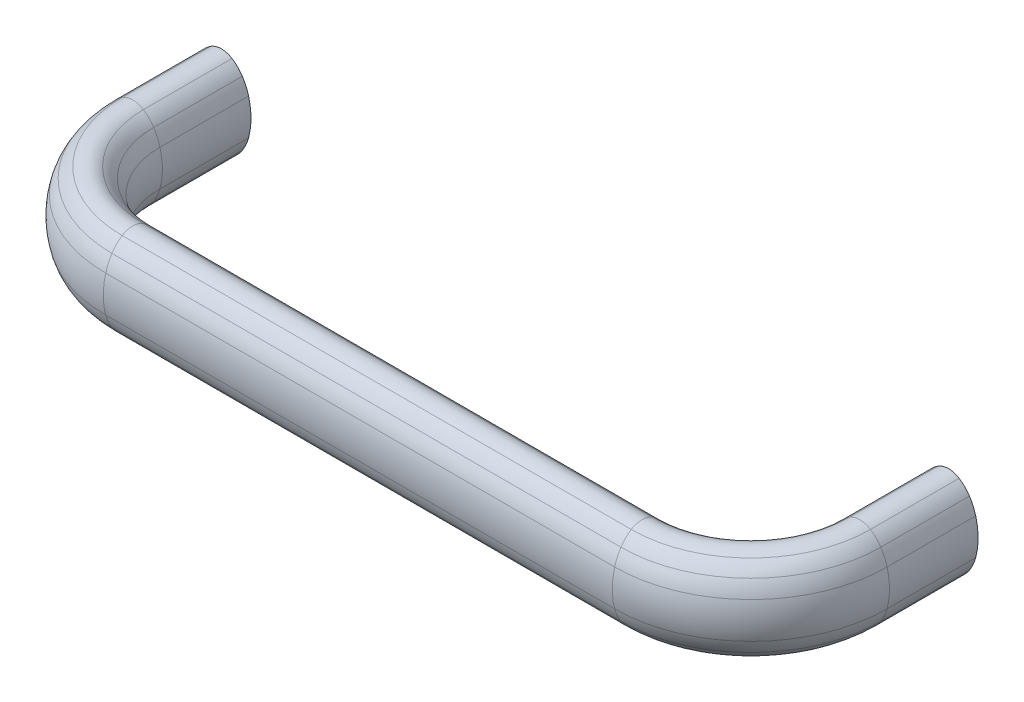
ISO-10303-21;
HEADER;
FILE_DESCRIPTION(('STEP AP214'),'2;1');
FILE_NAME('part.step','',(''),(''),'','','');
FILE_SCHEMA(('AUTOMOTIVE_DESIGN { 1 0 10303 214 1 1 1 1 }'));
ENDSEC;
DATA;
#1=APPLICATION_CONTEXT('core data for automotive mechanical design processes');
#2=APPLICATION_PROTOCOL_DEFINITION('international standard','automotive_design',2000,#1);
#3=PRODUCT_CONTEXT('',#1,'mechanical');
#4=PRODUCT('Part','Part','',(#3));
#5=PRODUCT_RELATED_PRODUCT_CATEGORY('part','',(#4));
#6=PRODUCT_DEFINITION_FORMATION('','',#4);
#7=PRODUCT_DEFINITION_CONTEXT('part definition',#1,'design');
#8=PRODUCT_DEFINITION('design','',#6,#7);
#9=PRODUCT_DEFINITION_SHAPE('','',#8);
#10=(LENGTH_UNIT() NAMED_UNIT(*) SI_UNIT(.MILLI.,.METRE.));
#11=(NAMED_UNIT(*) PLANE_ANGLE_UNIT() SI_UNIT($,.RADIAN.));
#12=(NAMED_UNIT(*) SI_UNIT($,.STERADIAN.) SOLID_ANGLE_UNIT());
#13=UNCERTAINTY_MEASURE_WITH_UNIT(LENGTH_MEASURE(1.E-05),#10,'distance_accuracy_value','');
#14=(GEOMETRIC_REPRESENTATION_CONTEXT(3) GLOBAL_UNCERTAINTY_ASSIGNED_CONTEXT((#13)) GLOBAL_UNIT_ASSIGNED_CONTEXT((#10,
#11,#12)) REPRESENTATION_CONTEXT('',''));
#15=CARTESIAN_POINT('',(0.,0.,0.));
#16=DIRECTION('',(0.,0.,1.));
#17=DIRECTION('',(1.,0.,0.));
#18=AXIS2_PLACEMENT_3D('',#15,#16,#17);
#19=CARTESIAN_POINT('',(158.266980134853,2.95863916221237,19.4999999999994));
#20=DIRECTION('',(0.,0.,-1.));
#21=DIRECTION('',(0.,1.,0.));
#22=AXIS2_PLACEMENT_3D('',#19,#20,#21);
#23=CYLINDRICAL_SURFACE('',#22,7.54594714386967);
#24=CARTESIAN_POINT('',(158.266980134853,2.95863916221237,19.4999999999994));
#25=DIRECTION('',(0.,0.,1.));
#26=DIRECTION('',(0.,1.,0.));
#27=AXIS2_PLACEMENT_3D('',#24,#25,#26);
#28=CIRCLE('',#27,7.54594714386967);
#29=CARTESIAN_POINT('',(164.593831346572,7.07109244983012,19.4999999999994));
#30=VERTEX_POINT('',#29);
#31=CARTESIAN_POINT('',(162.322235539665,9.32230335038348,19.4999999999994));
#32=VERTEX_POINT('',#31);
#33=EDGE_CURVE('E504',#30,#32,#28,.T.);
#34=ORIENTED_EDGE('',*,*,#33,.F.);
#35=DIRECTION('',(0.,0.,-1.));
#36=VECTOR('',#35,1.);
#37=CARTESIAN_POINT('',(164.593831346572,7.07109244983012,19.4999999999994));
#38=LINE('',#37,#36);
#39=CARTESIAN_POINT('',(164.593831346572,7.07109244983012,-2.35922392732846E-13));
#40=VERTEX_POINT('',#39);
#41=EDGE_CURVE('E22',#30,#40,#38,.T.);
#42=ORIENTED_EDGE('',*,*,#41,.T.);
#43=CARTESIAN_POINT('',(158.266980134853,2.95863916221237,-2.35922392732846E-13));
#44=DIRECTION('',(0.,0.,1.));
#45=DIRECTION('',(0.,1.,0.));
#46=AXIS2_PLACEMENT_3D('',#43,#44,#45);
#47=CIRCLE('',#46,7.54594714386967);
#48=CARTESIAN_POINT('',(162.322235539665,9.32230335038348,-2.35922392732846E-13));
#49=VERTEX_POINT('',#48);
#50=EDGE_CURVE('E17',#40,#49,#47,.T.);
#51=ORIENTED_EDGE('',*,*,#50,.T.);
#52=DIRECTION('',(0.,0.,-1.));
#53=VECTOR('',#52,1.);
#54=CARTESIAN_POINT('',(162.322235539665,9.32230335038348,19.4999999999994));
#55=LINE('',#54,#53);
#56=EDGE_CURVE('E9',#32,#49,#55,.T.);
#57=ORIENTED_EDGE('',*,*,#56,.F.);
#58=EDGE_LOOP('',(#34,#42,#51,#57));
#59=FACE_BOUND('',#58,.T.);
#60=ADVANCED_FACE('F14',(#59),#23,.T.);
#61=CARTESIAN_POINT('',(155.517667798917,1.17158614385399,19.4999999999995));
#62=DIRECTION('',(0.,0.,-1.));
#63=DIRECTION('',(0.,1.,0.));
#64=AXIS2_PLACEMENT_3D('',#61,#62,#63);
#65=CYLINDRICAL_SURFACE('',#64,10.8250135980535);
#66=CARTESIAN_POINT('',(155.517667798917,1.17158614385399,19.4999999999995));
#67=DIRECTION('',(0.,0.,1.));
#68=DIRECTION('',(0.,1.,0.));
#69=AXIS2_PLACEMENT_3D('',#66,#67,#68);
#70=CIRCLE('',#69,10.8250135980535);
#71=CARTESIAN_POINT('',(165.97045040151,3.98588095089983,19.4999999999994));
#72=VERTEX_POINT('',#71);
#73=EDGE_CURVE('E564',#72,#30,#70,.T.);
#74=ORIENTED_EDGE('',*,*,#73,.F.);
#75=DIRECTION('',(0.,0.,-1.));
#76=VECTOR('',#75,1.);
#77=CARTESIAN_POINT('',(165.97045040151,3.98588095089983,19.4999999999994));
#78=LINE('',#77,#76);
#79=CARTESIAN_POINT('',(165.97045040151,3.98588095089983,-2.35922392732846E-13));
#80=VERTEX_POINT('',#79);
#81=EDGE_CURVE('E596',#72,#80,#78,.T.);
#82=ORIENTED_EDGE('',*,*,#81,.T.);
#83=CARTESIAN_POINT('',(155.517667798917,1.17158614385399,-2.22044604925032E-13));
#84=DIRECTION('',(0.,0.,1.));
#85=DIRECTION('',(0.,1.,0.));
#86=AXIS2_PLACEMENT_3D('',#83,#84,#85);
#87=CIRCLE('',#86,10.8250135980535);
#88=EDGE_CURVE('E38',#80,#40,#87,.T.);
#89=ORIENTED_EDGE('',*,*,#88,.T.);
#90=ORIENTED_EDGE('',*,*,#41,.F.);
#91=EDGE_LOOP('',(#74,#82,#89,#90));
#92=FACE_BOUND('',#91,.T.);
#93=ADVANCED_FACE('F685',(#92),#65,.T.);
#94=CARTESIAN_POINT('',(151.166283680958,2.46379646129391E-05,19.4999999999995));
#95=DIRECTION('',(0.,0.,-1.));
#96=DIRECTION('',(0.,1.,0.));
#97=AXIS2_PLACEMENT_3D('',#94,#95,#96);
#98=CYLINDRICAL_SURFACE('',#97,15.331353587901);
#99=CARTESIAN_POINT('',(151.166283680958,2.46379646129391E-05,19.4999999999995));
#100=DIRECTION('',(0.,0.,1.));
#101=DIRECTION('',(0.,1.,0.));
#102=AXIS2_PLACEMENT_3D('',#99,#100,#101);
#103=CIRCLE('',#102,15.331353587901);
#104=CARTESIAN_POINT('',(165.97045040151,-3.98583167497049,19.4999999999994));
#105=VERTEX_POINT('',#104);
#106=EDGE_CURVE('E562',#105,#72,#103,.T.);
#107=ORIENTED_EDGE('',*,*,#106,.F.);
#108=DIRECTION('',(0.,0.,-1.));
#109=VECTOR('',#108,1.);
#110=CARTESIAN_POINT('',(165.97045040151,-3.98583167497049,19.4999999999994));
#111=LINE('',#110,#109);
#112=CARTESIAN_POINT('',(165.97045040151,-3.98583167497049,-2.35922392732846E-13));
#113=VERTEX_POINT('',#112);
#114=EDGE_CURVE('E593',#105,#113,#111,.T.);
#115=ORIENTED_EDGE('',*,*,#114,.T.);
#116=CARTESIAN_POINT('',(151.166283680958,2.46379646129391E-05,-2.22044604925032E-13));
#117=DIRECTION('',(0.,0.,1.));
#118=DIRECTION('',(0.,1.,0.));
#119=AXIS2_PLACEMENT_3D('',#116,#117,#118);
#120=CIRCLE('',#119,15.331353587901);
#121=EDGE_CURVE('E622',#113,#80,#120,.T.);
#122=ORIENTED_EDGE('',*,*,#121,.T.);
#123=ORIENTED_EDGE('',*,*,#81,.F.);
#124=EDGE_LOOP('',(#107,#115,#122,#123));
#125=FACE_BOUND('',#124,.T.);
#126=ADVANCED_FACE('F690',(#125),#98,.T.);
#127=CARTESIAN_POINT('',(155.517667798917,-1.1715368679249,19.4999999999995));
#128=DIRECTION('',(0.,0.,-1.));
#129=DIRECTION('',(0.,1.,0.));
#130=AXIS2_PLACEMENT_3D('',#127,#128,#129);
#131=CYLINDRICAL_SURFACE('',#130,10.8250135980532);
#132=CARTESIAN_POINT('',(155.517667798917,-1.1715368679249,19.4999999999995));
#133=DIRECTION('',(0.,0.,1.));
#134=DIRECTION('',(0.,1.,0.));
#135=AXIS2_PLACEMENT_3D('',#132,#133,#134);
#136=CIRCLE('',#135,10.8250135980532);
#137=CARTESIAN_POINT('',(164.593831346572,-7.07104317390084,19.4999999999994));
#138=VERTEX_POINT('',#137);
#139=EDGE_CURVE('E559',#138,#105,#136,.T.);
#140=ORIENTED_EDGE('',*,*,#139,.F.);
#141=DIRECTION('',(0.,0.,-1.));
#142=VECTOR('',#141,1.);
#143=CARTESIAN_POINT('',(164.593831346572,-7.07104317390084,19.4999999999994));
#144=LINE('',#143,#142);
#145=CARTESIAN_POINT('',(164.593831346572,-7.07104317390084,-2.35922392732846E-13));
#146=VERTEX_POINT('',#145);
#147=EDGE_CURVE('E590',#138,#146,#144,.T.);
#148=ORIENTED_EDGE('',*,*,#147,.T.);
#149=CARTESIAN_POINT('',(155.517667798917,-1.1715368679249,-2.22044604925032E-13));
#150=DIRECTION('',(0.,0.,1.));
#151=DIRECTION('',(0.,1.,0.));
#152=AXIS2_PLACEMENT_3D('',#149,#150,#151);
#153=CIRCLE('',#152,10.8250135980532);
#154=EDGE_CURVE('E620',#146,#113,#153,.T.);
#155=ORIENTED_EDGE('',*,*,#154,.T.);
#156=ORIENTED_EDGE('',*,*,#114,.F.);
#157=EDGE_LOOP('',(#140,#148,#155,#156));
#158=FACE_BOUND('',#157,.T.);
#159=ADVANCED_FACE('F695',(#158),#131,.T.);
#160=CARTESIAN_POINT('',(158.266980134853,-2.95858988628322,19.4999999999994));
#161=DIRECTION('',(0.,0.,-1.));
#162=DIRECTION('',(0.,1.,0.));
#163=AXIS2_PLACEMENT_3D('',#160,#161,#162);
#164=CYLINDRICAL_SURFACE('',#163,7.54594714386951);
#165=CARTESIAN_POINT('',(158.266980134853,-2.95858988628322,19.4999999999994));
#166=DIRECTION('',(0.,0.,1.));
#167=DIRECTION('',(0.,1.,0.));
#168=AXIS2_PLACEMENT_3D('',#165,#166,#167);
#169=CIRCLE('',#168,7.54594714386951);
#170=CARTESIAN_POINT('',(162.322235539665,-9.32225407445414,19.4999999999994));
#171=VERTEX_POINT('',#170);
#172=EDGE_CURVE('E556',#171,#138,#169,.T.);
#173=ORIENTED_EDGE('',*,*,#172,.F.);
#174=DIRECTION('',(0.,0.,-1.));
#175=VECTOR('',#174,1.);
#176=CARTESIAN_POINT('',(162.322235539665,-9.32225407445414,19.4999999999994));
#177=LINE('',#176,#175);
#178=CARTESIAN_POINT('',(162.322235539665,-9.32225407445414,-2.35922392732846E-13));
#179=VERTEX_POINT('',#178);
#180=EDGE_CURVE('E587',#171,#179,#177,.T.);
#181=ORIENTED_EDGE('',*,*,#180,.T.);
#182=CARTESIAN_POINT('',(158.266980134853,-2.95858988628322,-2.35922392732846E-13));
#183=DIRECTION('',(0.,0.,1.));
#184=DIRECTION('',(0.,1.,0.));
#185=AXIS2_PLACEMENT_3D('',#182,#183,#184);
#186=CIRCLE('',#185,7.54594714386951);
#187=EDGE_CURVE('E618',#179,#146,#186,.T.);
#188=ORIENTED_EDGE('',*,*,#187,.T.);
#189=ORIENTED_EDGE('',*,*,#147,.F.);
#190=EDGE_LOOP('',(#173,#181,#188,#189));
#191=FACE_BOUND('',#190,.T.);
#192=ADVANCED_FACE('F701',(#191),#164,.T.);
#193=CARTESIAN_POINT('',(159.997637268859,-5.67440423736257,19.4999999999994));
#194=DIRECTION('',(0.,0.,-1.));
#195=DIRECTION('',(0.,1.,0.));
#196=AXIS2_PLACEMENT_3D('',#193,#194,#195);
#197=CYLINDRICAL_SURFACE('',#196,4.3255711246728);
#198=CARTESIAN_POINT('',(159.997637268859,-5.67440423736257,19.4999999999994));
#199=DIRECTION('',(0.,0.,-1.));
#200=DIRECTION('',(0.,-1.,0.));
#201=AXIS2_PLACEMENT_3D('',#198,#199,#200);
#202=CIRCLE('',#201,4.3255711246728);
#203=CARTESIAN_POINT('',(157.673038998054,-9.32225407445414,19.4999999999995));
#204=VERTEX_POINT('',#203);
#205=EDGE_CURVE('E553',#171,#204,#202,.T.);
#206=ORIENTED_EDGE('',*,*,#205,.T.);
#207=DIRECTION('',(0.,0.,-1.));
#208=VECTOR('',#207,1.);
#209=CARTESIAN_POINT('',(157.673038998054,-9.32225407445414,19.4999999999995));
#210=LINE('',#209,#208);
#211=CARTESIAN_POINT('',(157.673038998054,-9.32225407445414,-2.22044604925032E-13));
#212=VERTEX_POINT('',#211);
#213=EDGE_CURVE('E584',#204,#212,#210,.T.);
#214=ORIENTED_EDGE('',*,*,#213,.T.);
#215=CARTESIAN_POINT('',(159.997637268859,-5.67440423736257,-2.35922392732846E-13));
#216=DIRECTION('',(0.,0.,-1.));
#217=DIRECTION('',(0.,-1.,0.));
#218=AXIS2_PLACEMENT_3D('',#215,#216,#217);
#219=CIRCLE('',#218,4.3255711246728);
#220=EDGE_CURVE('E615',#179,#212,#219,.T.);
#221=ORIENTED_EDGE('',*,*,#220,.F.);
#222=ORIENTED_EDGE('',*,*,#180,.F.);
#223=EDGE_LOOP('',(#206,#214,#221,#222));
#224=FACE_BOUND('',#223,.T.);
#225=ADVANCED_FACE('F705',(#224),#197,.T.);
#226=CARTESIAN_POINT('',(161.728294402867,-2.95858988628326,19.4999999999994));
#227=DIRECTION('',(0.,0.,-1.));
#228=DIRECTION('',(0.,1.,0.));
#229=AXIS2_PLACEMENT_3D('',#226,#227,#228);
#230=CYLINDRICAL_SURFACE('',#229,7.54594714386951);
#231=CARTESIAN_POINT('',(161.728294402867,-2.95858988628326,19.4999999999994));
#232=DIRECTION('',(0.,0.,-1.));
#233=DIRECTION('',(0.,-1.,0.));
#234=AXIS2_PLACEMENT_3D('',#231,#232,#233);
#235=CIRCLE('',#234,7.54594714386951);
#236=CARTESIAN_POINT('',(155.401443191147,-7.07104317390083,19.4999999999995));
#237=VERTEX_POINT('',#236);
#238=EDGE_CURVE('E550',#204,#237,#235,.T.);
#239=ORIENTED_EDGE('',*,*,#238,.T.);
#240=DIRECTION('',(0.,0.,-1.));
#241=VECTOR('',#240,1.);
#242=CARTESIAN_POINT('',(155.401443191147,-7.07104317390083,19.4999999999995));
#243=LINE('',#242,#241);
#244=CARTESIAN_POINT('',(155.401443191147,-7.07104317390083,-2.22044604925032E-13));
#245=VERTEX_POINT('',#244);
#246=EDGE_CURVE('E581',#237,#245,#243,.T.);
#247=ORIENTED_EDGE('',*,*,#246,.T.);
#248=CARTESIAN_POINT('',(161.728294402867,-2.95858988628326,-2.35922392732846E-13));
#249=DIRECTION('',(0.,0.,-1.));
#250=DIRECTION('',(0.,-1.,0.));
#251=AXIS2_PLACEMENT_3D('',#248,#249,#250);
#252=CIRCLE('',#251,7.54594714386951);
#253=EDGE_CURVE('E612',#212,#245,#252,.T.);
#254=ORIENTED_EDGE('',*,*,#253,.F.);
#255=ORIENTED_EDGE('',*,*,#213,.F.);
#256=EDGE_LOOP('',(#239,#247,#254,#255));
#257=FACE_BOUND('',#256,.T.);
#258=ADVANCED_FACE('F709',(#257),#230,.T.);
#259=CARTESIAN_POINT('',(164.477606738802,-1.17153686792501,19.4999999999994));
#260=DIRECTION('',(0.,0.,-1.));
#261=DIRECTION('',(0.,1.,0.));
#262=AXIS2_PLACEMENT_3D('',#259,#260,#261);
#263=CYLINDRICAL_SURFACE('',#262,10.8250135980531);
#264=CARTESIAN_POINT('',(164.477606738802,-1.17153686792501,19.4999999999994));
#265=DIRECTION('',(0.,0.,-1.));
#266=DIRECTION('',(0.,-1.,0.));
#267=AXIS2_PLACEMENT_3D('',#264,#265,#266);
#268=CIRCLE('',#267,10.8250135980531);
#269=CARTESIAN_POINT('',(154.02482413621,-3.98583167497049,19.4999999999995));
#270=VERTEX_POINT('',#269);
#271=EDGE_CURVE('E547',#237,#270,#268,.T.);
#272=ORIENTED_EDGE('',*,*,#271,.T.);
#273=DIRECTION('',(0.,0.,-1.));
#274=VECTOR('',#273,1.);
#275=CARTESIAN_POINT('',(154.02482413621,-3.98583167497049,19.4999999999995));
#276=LINE('',#275,#274);
#277=CARTESIAN_POINT('',(154.02482413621,-3.98583167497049,-2.22044604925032E-13));
#278=VERTEX_POINT('',#277);
#279=EDGE_CURVE('E578',#270,#278,#276,.T.);
#280=ORIENTED_EDGE('',*,*,#279,.T.);
#281=CARTESIAN_POINT('',(164.477606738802,-1.17153686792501,-2.35922392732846E-13));
#282=DIRECTION('',(0.,0.,-1.));
#283=DIRECTION('',(0.,-1.,0.));
#284=AXIS2_PLACEMENT_3D('',#281,#282,#283);
#285=CIRCLE('',#284,10.8250135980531);
#286=EDGE_CURVE('E609',#245,#278,#285,.T.);
#287=ORIENTED_EDGE('',*,*,#286,.F.);
#288=ORIENTED_EDGE('',*,*,#246,.F.);
#289=EDGE_LOOP('',(#272,#280,#287,#288));
#290=FACE_BOUND('',#289,.T.);
#291=ADVANCED_FACE('F713',(#290),#263,.T.);
#292=CARTESIAN_POINT('',(168.82899085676,2.46379646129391E-05,19.4999999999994));
#293=DIRECTION('',(0.,0.,-1.));
#294=DIRECTION('',(0.,1.,0.));
#295=AXIS2_PLACEMENT_3D('',#292,#293,#294);
#296=CYLINDRICAL_SURFACE('',#295,15.331353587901);
#297=CARTESIAN_POINT('',(168.82899085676,2.46379646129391E-05,19.4999999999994));
#298=DIRECTION('',(0.,0.,-1.));
#299=DIRECTION('',(0.,-1.,0.));
#300=AXIS2_PLACEMENT_3D('',#297,#298,#299);
#301=CIRCLE('',#300,15.331353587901);
#302=CARTESIAN_POINT('',(154.02482413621,3.98588095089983,19.4999999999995));
#303=VERTEX_POINT('',#302);
#304=EDGE_CURVE('E544',#270,#303,#301,.T.);
#305=ORIENTED_EDGE('',*,*,#304,.T.);
#306=DIRECTION('',(0.,0.,-1.));
#307=VECTOR('',#306,1.);
#308=CARTESIAN_POINT('',(154.02482413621,3.98588095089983,19.4999999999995));
#309=LINE('',#308,#307);
#310=CARTESIAN_POINT('',(154.02482413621,3.98588095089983,-2.22044604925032E-13));
#311=VERTEX_POINT('',#310);
#312=EDGE_CURVE('E575',#303,#311,#309,.T.);
#313=ORIENTED_EDGE('',*,*,#312,.T.);
#314=CARTESIAN_POINT('',(168.82899085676,2.46379646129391E-05,-2.4980018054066E-13));
#315=DIRECTION('',(0.,0.,-1.));
#316=DIRECTION('',(0.,-1.,0.));
#317=AXIS2_PLACEMENT_3D('',#314,#315,#316);
#318=CIRCLE('',#317,15.331353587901);
#319=EDGE_CURVE('E606',#278,#311,#318,.T.);
#320=ORIENTED_EDGE('',*,*,#319,.F.);
#321=ORIENTED_EDGE('',*,*,#279,.F.);
#322=EDGE_LOOP('',(#305,#313,#320,#321));
#323=FACE_BOUND('',#322,.T.);
#324=ADVANCED_FACE('F717',(#323),#296,.T.);
#325=CARTESIAN_POINT('',(164.477606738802,1.1715861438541,19.4999999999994));
#326=DIRECTION('',(0.,0.,-1.));
#327=DIRECTION('',(0.,1.,0.));
#328=AXIS2_PLACEMENT_3D('',#325,#326,#327);
#329=CYLINDRICAL_SURFACE('',#328,10.8250135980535);
#330=CARTESIAN_POINT('',(164.477606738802,1.1715861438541,19.4999999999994));
#331=DIRECTION('',(0.,0.,-1.));
#332=DIRECTION('',(0.,-1.,0.));
#333=AXIS2_PLACEMENT_3D('',#330,#331,#332);
#334=CIRCLE('',#333,10.8250135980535);
#335=CARTESIAN_POINT('',(155.401443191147,7.07109244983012,19.4999999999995));
#336=VERTEX_POINT('',#335);
#337=EDGE_CURVE('E541',#303,#336,#334,.T.);
#338=ORIENTED_EDGE('',*,*,#337,.T.);
#339=DIRECTION('',(0.,0.,-1.));
#340=VECTOR('',#339,1.);
#341=CARTESIAN_POINT('',(155.401443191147,7.07109244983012,19.4999999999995));
#342=LINE('',#341,#340);
#343=CARTESIAN_POINT('',(155.401443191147,7.07109244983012,-2.22044604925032E-13));
#344=VERTEX_POINT('',#343);
#345=EDGE_CURVE('E572',#336,#344,#342,.T.);
#346=ORIENTED_EDGE('',*,*,#345,.T.);
#347=CARTESIAN_POINT('',(164.477606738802,1.1715861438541,-2.35922392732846E-13));
#348=DIRECTION('',(0.,0.,-1.));
#349=DIRECTION('',(0.,-1.,0.));
#350=AXIS2_PLACEMENT_3D('',#347,#348,#349);
#351=CIRCLE('',#350,10.8250135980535);
#352=EDGE_CURVE('E603',#311,#344,#351,.T.);
#353=ORIENTED_EDGE('',*,*,#352,.F.);
#354=ORIENTED_EDGE('',*,*,#312,.F.);
#355=EDGE_LOOP('',(#338,#346,#353,#354));
#356=FACE_BOUND('',#355,.T.);
#357=ADVANCED_FACE('F721',(#356),#329,.T.);
#358=CARTESIAN_POINT('',(161.728294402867,2.95863916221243,19.4999999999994));
#359=DIRECTION('',(0.,0.,-1.));
#360=DIRECTION('',(0.,1.,0.));
#361=AXIS2_PLACEMENT_3D('',#358,#359,#360);
#362=CYLINDRICAL_SURFACE('',#361,7.54594714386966);
#363=CARTESIAN_POINT('',(161.728294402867,2.95863916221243,19.4999999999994));
#364=DIRECTION('',(0.,0.,-1.));
#365=DIRECTION('',(0.,-1.,0.));
#366=AXIS2_PLACEMENT_3D('',#363,#364,#365);
#367=CIRCLE('',#366,7.54594714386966);
#368=CARTESIAN_POINT('',(157.673038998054,9.32230335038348,19.4999999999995));
#369=VERTEX_POINT('',#368);
#370=EDGE_CURVE('E538',#336,#369,#367,.T.);
#371=ORIENTED_EDGE('',*,*,#370,.T.);
#372=DIRECTION('',(0.,0.,-1.));
#373=VECTOR('',#372,1.);
#374=CARTESIAN_POINT('',(157.673038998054,9.32230335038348,19.4999999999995));
#375=LINE('',#374,#373);
#376=CARTESIAN_POINT('',(157.673038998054,9.32230335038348,-2.22044604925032E-13));
#377=VERTEX_POINT('',#376);
#378=EDGE_CURVE('E569',#369,#377,#375,.T.);
#379=ORIENTED_EDGE('',*,*,#378,.T.);
#380=CARTESIAN_POINT('',(161.728294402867,2.95863916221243,-2.35922392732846E-13));
#381=DIRECTION('',(0.,0.,-1.));
#382=DIRECTION('',(0.,-1.,0.));
#383=AXIS2_PLACEMENT_3D('',#380,#381,#382);
#384=CIRCLE('',#383,7.54594714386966);
#385=EDGE_CURVE('E601',#344,#377,#384,.T.);
#386=ORIENTED_EDGE('',*,*,#385,.F.);
#387=ORIENTED_EDGE('',*,*,#345,.F.);
#388=EDGE_LOOP('',(#371,#379,#386,#387));
#389=FACE_BOUND('',#388,.T.);
#390=ADVANCED_FACE('F682',(#389),#362,.T.);
#391=CARTESIAN_POINT('',(159.997637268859,5.67445351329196,19.4999999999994));
#392=DIRECTION('',(0.,0.,-1.));
#393=DIRECTION('',(0.,1.,0.));
#394=AXIS2_PLACEMENT_3D('',#391,#392,#393);
#395=CYLINDRICAL_SURFACE('',#394,4.32557112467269);
#396=CARTESIAN_POINT('',(159.997637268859,5.67445351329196,19.4999999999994));
#397=DIRECTION('',(0.,0.,-1.));
#398=DIRECTION('',(0.,-1.,0.));
#399=AXIS2_PLACEMENT_3D('',#396,#397,#398);
#400=CIRCLE('',#399,4.32557112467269);
#401=EDGE_CURVE('E467',#369,#32,#400,.T.);
#402=ORIENTED_EDGE('',*,*,#401,.T.);
#403=ORIENTED_EDGE('',*,*,#56,.T.);
#404=CARTESIAN_POINT('',(159.997637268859,5.67445351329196,-2.35922392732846E-13));
#405=DIRECTION('',(0.,0.,-1.));
#406=DIRECTION('',(0.,-1.,0.));
#407=AXIS2_PLACEMENT_3D('',#404,#405,#406);
#408=CIRCLE('',#407,4.32557112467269);
#409=EDGE_CURVE('E30',#377,#49,#408,.T.);
#410=ORIENTED_EDGE('',*,*,#409,.F.);
#411=ORIENTED_EDGE('',*,*,#378,.F.);
#412=EDGE_LOOP('',(#402,#403,#410,#411));
#413=FACE_BOUND('',#412,.T.);
#414=ADVANCED_FACE('F627',(#413),#395,.T.);
#415=CARTESIAN_POINT('',(136.,2.95863916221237,19.4999999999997));
#416=DIRECTION('',(0.,1.,0.));
#417=DIRECTION('',(-1.,0.,0.));
#418=AXIS2_PLACEMENT_3D('',#415,#416,#417);
#419=TOROIDAL_SURFACE('',#418,22.2669801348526,7.54594714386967);
#420=CARTESIAN_POINT('',(136.,2.95863916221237,41.7669801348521));
#421=DIRECTION('',(-1.,0.,0.));
#422=DIRECTION('',(0.,1.,0.));
#423=AXIS2_PLACEMENT_3D('',#420,#421,#422);
#424=CIRCLE('',#423,7.54594714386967);
#425=CARTESIAN_POINT('',(136.,7.07109244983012,48.0938313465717));
#426=VERTEX_POINT('',#425);
#427=CARTESIAN_POINT('',(136.,9.32230335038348,45.8222355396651));
#428=VERTEX_POINT('',#427);
#429=EDGE_CURVE('E434',#426,#428,#424,.T.);
#430=ORIENTED_EDGE('',*,*,#429,.F.);
#431=CARTESIAN_POINT('',(136.,7.07109244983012,19.4999999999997));
#432=DIRECTION('',(0.,1.,0.));
#433=DIRECTION('',(-1.,0.,0.));
#434=AXIS2_PLACEMENT_3D('',#431,#432,#433);
#435=CIRCLE('',#434,28.5938313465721);
#436=EDGE_CURVE('E531',#426,#30,#435,.T.);
#437=ORIENTED_EDGE('',*,*,#436,.T.);
#438=ORIENTED_EDGE('',*,*,#33,.T.);
#439=CARTESIAN_POINT('',(136.,9.32230335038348,19.4999999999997));
#440=DIRECTION('',(0.,1.,0.));
#441=DIRECTION('',(-1.,0.,0.));
#442=AXIS2_PLACEMENT_3D('',#439,#440,#441);
#443=CIRCLE('',#442,26.3222355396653);
#444=EDGE_CURVE('E534',#428,#32,#443,.T.);
#445=ORIENTED_EDGE('',*,*,#444,.F.);
#446=EDGE_LOOP('',(#430,#437,#438,#445));
#447=FACE_BOUND('',#446,.T.);
#448=ADVANCED_FACE('F671',(#447),#419,.T.);
#449=CARTESIAN_POINT('',(136.,1.17158614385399,19.4999999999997));
#450=DIRECTION('',(0.,1.,0.));
#451=DIRECTION('',(-1.,0.,0.));
#452=AXIS2_PLACEMENT_3D('',#449,#450,#451);
#453=TOROIDAL_SURFACE('',#452,19.5176677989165,10.8250135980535);
#454=CARTESIAN_POINT('',(136.,1.17158614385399,39.0176677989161));
#455=DIRECTION('',(-1.,0.,0.));
#456=DIRECTION('',(0.,1.,0.));
#457=AXIS2_PLACEMENT_3D('',#454,#455,#456);
#458=CIRCLE('',#457,10.8250135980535);
#459=CARTESIAN_POINT('',(136.,3.98588095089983,49.4704504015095));
#460=VERTEX_POINT('',#459);
#461=EDGE_CURVE('E495',#460,#426,#458,.T.);
#462=ORIENTED_EDGE('',*,*,#461,.F.);
#463=CARTESIAN_POINT('',(136.,3.98588095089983,19.4999999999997));
#464=DIRECTION('',(0.,1.,0.));
#465=DIRECTION('',(-1.,0.,0.));
#466=AXIS2_PLACEMENT_3D('',#463,#464,#465);
#467=CIRCLE('',#466,29.9704504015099);
#468=EDGE_CURVE('E528',#460,#72,#467,.T.);
#469=ORIENTED_EDGE('',*,*,#468,.T.);
#470=ORIENTED_EDGE('',*,*,#73,.T.);
#471=ORIENTED_EDGE('',*,*,#436,.F.);
#472=EDGE_LOOP('',(#462,#469,#470,#471));
#473=FACE_BOUND('',#472,.T.);
#474=ADVANCED_FACE('F666',(#473),#453,.T.);
#475=CARTESIAN_POINT('',(136.,2.46379646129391E-05,19.4999999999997));
#476=DIRECTION('',(0.,1.,0.));
#477=DIRECTION('',(-1.,0.,0.));
#478=AXIS2_PLACEMENT_3D('',#475,#476,#477);
#479=DEGENERATE_TOROIDAL_SURFACE('',#478,15.1662836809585,15.331353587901,.T.);
#480=CARTESIAN_POINT('',(136.,2.46379646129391E-05,34.6662836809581));
#481=DIRECTION('',(-1.,0.,0.));
#482=DIRECTION('',(0.,1.,0.));
#483=AXIS2_PLACEMENT_3D('',#480,#481,#482);
#484=CIRCLE('',#483,15.331353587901);
#485=CARTESIAN_POINT('',(136.,-3.98583167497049,49.4704504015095));
#486=VERTEX_POINT('',#485);
#487=EDGE_CURVE('E493',#486,#460,#484,.T.);
#488=ORIENTED_EDGE('',*,*,#487,.F.);
#489=CARTESIAN_POINT('',(136.,-3.98583167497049,19.4999999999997));
#490=DIRECTION('',(0.,1.,0.));
#491=DIRECTION('',(-1.,0.,0.));
#492=AXIS2_PLACEMENT_3D('',#489,#490,#491);
#493=CIRCLE('',#492,29.9704504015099);
#494=EDGE_CURVE('E525',#486,#105,#493,.T.);
#495=ORIENTED_EDGE('',*,*,#494,.T.);
#496=ORIENTED_EDGE('',*,*,#106,.T.);
#497=ORIENTED_EDGE('',*,*,#468,.F.);
#498=EDGE_LOOP('',(#488,#495,#496,#497));
#499=FACE_BOUND('',#498,.T.);
#500=ADVANCED_FACE('F680',(#499),#479,.T.);
#501=CARTESIAN_POINT('',(136.,-1.1715368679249,19.4999999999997));
#502=DIRECTION('',(0.,1.,0.));
#503=DIRECTION('',(-1.,0.,0.));
#504=AXIS2_PLACEMENT_3D('',#501,#502,#503);
#505=TOROIDAL_SURFACE('',#504,19.5176677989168,10.8250135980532);
#506=CARTESIAN_POINT('',(136.,-1.1715368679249,39.0176677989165));
#507=DIRECTION('',(-1.,0.,0.));
#508=DIRECTION('',(0.,1.,0.));
#509=AXIS2_PLACEMENT_3D('',#506,#507,#508);
#510=CIRCLE('',#509,10.8250135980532);
#511=CARTESIAN_POINT('',(136.,-7.07104317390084,48.0938313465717));
#512=VERTEX_POINT('',#511);
#513=EDGE_CURVE('E490',#512,#486,#510,.T.);
#514=ORIENTED_EDGE('',*,*,#513,.F.);
#515=CARTESIAN_POINT('',(136.,-7.07104317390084,19.4999999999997));
#516=DIRECTION('',(0.,1.,0.));
#517=DIRECTION('',(-1.,0.,0.));
#518=AXIS2_PLACEMENT_3D('',#515,#516,#517);
#519=CIRCLE('',#518,28.5938313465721);
#520=EDGE_CURVE('E522',#512,#138,#519,.T.);
#521=ORIENTED_EDGE('',*,*,#520,.T.);
#522=ORIENTED_EDGE('',*,*,#139,.T.);
#523=ORIENTED_EDGE('',*,*,#494,.F.);
#524=EDGE_LOOP('',(#514,#521,#522,#523));
#525=FACE_BOUND('',#524,.T.);
#526=ADVANCED_FACE('F898',(#525),#505,.T.);
#527=CARTESIAN_POINT('',(136.,-2.95858988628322,19.4999999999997));
#528=DIRECTION('',(0.,1.,0.));
#529=DIRECTION('',(-1.,0.,0.));
#530=AXIS2_PLACEMENT_3D('',#527,#528,#529);
#531=TOROIDAL_SURFACE('',#530,22.2669801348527,7.54594714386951);
#532=CARTESIAN_POINT('',(136.,-2.95858988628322,41.7669801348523));
#533=DIRECTION('',(-1.,0.,0.));
#534=DIRECTION('',(0.,1.,0.));
#535=AXIS2_PLACEMENT_3D('',#532,#533,#534);
#536=CIRCLE('',#535,7.54594714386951);
#537=CARTESIAN_POINT('',(136.,-9.32225407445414,45.8222355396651));
#538=VERTEX_POINT('',#537);
#539=EDGE_CURVE('E487',#538,#512,#536,.T.);
#540=ORIENTED_EDGE('',*,*,#539,.F.);
#541=CARTESIAN_POINT('',(136.,-9.32225407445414,19.4999999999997));
#542=DIRECTION('',(0.,1.,0.));
#543=DIRECTION('',(-1.,0.,0.));
#544=AXIS2_PLACEMENT_3D('',#541,#542,#543);
#545=CIRCLE('',#544,26.3222355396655);
#546=EDGE_CURVE('E519',#538,#171,#545,.T.);
#547=ORIENTED_EDGE('',*,*,#546,.T.);
#548=ORIENTED_EDGE('',*,*,#172,.T.);
#549=ORIENTED_EDGE('',*,*,#520,.F.);
#550=EDGE_LOOP('',(#540,#547,#548,#549));
#551=FACE_BOUND('',#550,.T.);
#552=ADVANCED_FACE('F894',(#551),#531,.T.);
#553=CARTESIAN_POINT('',(136.,-5.67440423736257,19.4999999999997));
#554=DIRECTION('',(0.,1.,0.));
#555=DIRECTION('',(-1.,0.,0.));
#556=AXIS2_PLACEMENT_3D('',#553,#554,#555);
#557=TOROIDAL_SURFACE('',#556,23.9976372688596,4.3255711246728);
#558=CARTESIAN_POINT('',(136.,-5.67440423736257,43.4976372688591));
#559=DIRECTION('',(1.,0.,0.));
#560=DIRECTION('',(0.,-1.,0.));
#561=AXIS2_PLACEMENT_3D('',#558,#559,#560);
#562=CIRCLE('',#561,4.3255711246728);
#563=CARTESIAN_POINT('',(136.,-9.32225407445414,41.1730389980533));
#564=VERTEX_POINT('',#563);
#565=EDGE_CURVE('E484',#538,#564,#562,.T.);
#566=ORIENTED_EDGE('',*,*,#565,.T.);
#567=CARTESIAN_POINT('',(136.,-9.32225407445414,19.4999999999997));
#568=DIRECTION('',(0.,1.,0.));
#569=DIRECTION('',(-1.,0.,0.));
#570=AXIS2_PLACEMENT_3D('',#567,#568,#569);
#571=CIRCLE('',#570,21.6730389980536);
#572=EDGE_CURVE('E516',#564,#204,#571,.T.);
#573=ORIENTED_EDGE('',*,*,#572,.T.);
#574=ORIENTED_EDGE('',*,*,#205,.F.);
#575=ORIENTED_EDGE('',*,*,#546,.F.);
#576=EDGE_LOOP('',(#566,#573,#574,#575));
#577=FACE_BOUND('',#576,.T.);
#578=ADVANCED_FACE('F890',(#577),#557,.T.);
#579=CARTESIAN_POINT('',(136.,-2.95858988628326,19.4999999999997));
#580=DIRECTION('',(0.,1.,0.));
#581=DIRECTION('',(-1.,0.,0.));
#582=AXIS2_PLACEMENT_3D('',#579,#580,#581);
#583=TOROIDAL_SURFACE('',#582,25.7282944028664,7.54594714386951);
#584=CARTESIAN_POINT('',(136.,-2.95858988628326,45.2282944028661));
#585=DIRECTION('',(1.,0.,0.));
#586=DIRECTION('',(0.,-1.,0.));
#587=AXIS2_PLACEMENT_3D('',#584,#585,#586);
#588=CIRCLE('',#587,7.54594714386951);
#589=CARTESIAN_POINT('',(136.,-7.07104317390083,38.9014431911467));
#590=VERTEX_POINT('',#589);
#591=EDGE_CURVE('E481',#564,#590,#588,.T.);
#592=ORIENTED_EDGE('',*,*,#591,.T.);
#593=CARTESIAN_POINT('',(136.,-7.07104317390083,19.4999999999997));
#594=DIRECTION('',(0.,1.,0.));
#595=DIRECTION('',(-1.,0.,0.));
#596=AXIS2_PLACEMENT_3D('',#593,#594,#595);
#597=CIRCLE('',#596,19.401443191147);
#598=EDGE_CURVE('E513',#590,#237,#597,.T.);
#599=ORIENTED_EDGE('',*,*,#598,.T.);
#600=ORIENTED_EDGE('',*,*,#238,.F.);
#601=ORIENTED_EDGE('',*,*,#572,.F.);
#602=EDGE_LOOP('',(#592,#599,#600,#601));
#603=FACE_BOUND('',#602,.T.);
#604=ADVANCED_FACE('F886',(#603),#583,.T.);
#605=CARTESIAN_POINT('',(136.,-1.17153686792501,19.4999999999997));
#606=DIRECTION('',(0.,1.,0.));
#607=DIRECTION('',(-1.,0.,0.));
#608=AXIS2_PLACEMENT_3D('',#605,#606,#607);
#609=TOROIDAL_SURFACE('',#608,28.4776067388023,10.8250135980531);
#610=CARTESIAN_POINT('',(136.,-1.17153686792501,47.9776067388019));
#611=DIRECTION('',(1.,0.,0.));
#612=DIRECTION('',(0.,-1.,0.));
#613=AXIS2_PLACEMENT_3D('',#610,#611,#612);
#614=CIRCLE('',#613,10.8250135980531);
#615=CARTESIAN_POINT('',(136.,-3.98583167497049,37.5248241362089));
#616=VERTEX_POINT('',#615);
#617=EDGE_CURVE('E478',#590,#616,#614,.T.);
#618=ORIENTED_EDGE('',*,*,#617,.T.);
#619=CARTESIAN_POINT('',(136.,-3.98583167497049,19.4999999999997));
#620=DIRECTION('',(0.,1.,0.));
#621=DIRECTION('',(-1.,0.,0.));
#622=AXIS2_PLACEMENT_3D('',#619,#620,#621);
#623=CIRCLE('',#622,18.0248241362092);
#624=EDGE_CURVE('E510',#616,#270,#623,.T.);
#625=ORIENTED_EDGE('',*,*,#624,.T.);
#626=ORIENTED_EDGE('',*,*,#271,.F.);
#627=ORIENTED_EDGE('',*,*,#598,.F.);
#628=EDGE_LOOP('',(#618,#625,#626,#627));
#629=FACE_BOUND('',#628,.T.);
#630=ADVANCED_FACE('F883',(#629),#609,.T.);
#631=CARTESIAN_POINT('',(136.,2.46379646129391E-05,19.4999999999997));
#632=DIRECTION('',(0.,1.,0.));
#633=DIRECTION('',(-1.,0.,0.));
#634=AXIS2_PLACEMENT_3D('',#631,#632,#633);
#635=TOROIDAL_SURFACE('',#634,32.8289908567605,15.331353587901);
#636=CARTESIAN_POINT('',(136.,2.46379646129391E-05,52.3289908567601));
#637=DIRECTION('',(1.,0.,0.));
#638=DIRECTION('',(0.,-1.,0.));
#639=AXIS2_PLACEMENT_3D('',#636,#637,#638);
#640=CIRCLE('',#639,15.331353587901);
#641=CARTESIAN_POINT('',(136.,3.98588095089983,37.5248241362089));
#642=VERTEX_POINT('',#641);
#643=EDGE_CURVE('E475',#616,#642,#640,.T.);
#644=ORIENTED_EDGE('',*,*,#643,.T.);
#645=CARTESIAN_POINT('',(136.,3.98588095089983,19.4999999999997));
#646=DIRECTION('',(0.,1.,0.));
#647=DIRECTION('',(-1.,0.,0.));
#648=AXIS2_PLACEMENT_3D('',#645,#646,#647);
#649=CIRCLE('',#648,18.0248241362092);
#650=EDGE_CURVE('E507',#642,#303,#649,.T.);
#651=ORIENTED_EDGE('',*,*,#650,.T.);
#652=ORIENTED_EDGE('',*,*,#304,.F.);
#653=ORIENTED_EDGE('',*,*,#624,.F.);
#654=EDGE_LOOP('',(#644,#651,#652,#653));
#655=FACE_BOUND('',#654,.T.);
#656=ADVANCED_FACE('F735',(#655),#635,.T.);
#657=CARTESIAN_POINT('',(136.,1.1715861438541,19.4999999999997));
#658=DIRECTION('',(0.,1.,0.));
#659=DIRECTION('',(-1.,0.,0.));
#660=AXIS2_PLACEMENT_3D('',#657,#658,#659);
#661=TOROIDAL_SURFACE('',#660,28.4776067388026,10.8250135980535);
#662=CARTESIAN_POINT('',(136.,1.1715861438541,47.9776067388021));
#663=DIRECTION('',(1.,0.,0.));
#664=DIRECTION('',(0.,-1.,0.));
#665=AXIS2_PLACEMENT_3D('',#662,#663,#664);
#666=CIRCLE('',#665,10.8250135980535);
#667=CARTESIAN_POINT('',(136.,7.07109244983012,38.9014431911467));
#668=VERTEX_POINT('',#667);
#669=EDGE_CURVE('E472',#642,#668,#666,.T.);
#670=ORIENTED_EDGE('',*,*,#669,.T.);
#671=CARTESIAN_POINT('',(136.,7.07109244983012,19.4999999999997));
#672=DIRECTION('',(0.,1.,0.));
#673=DIRECTION('',(-1.,0.,0.));
#674=AXIS2_PLACEMENT_3D('',#671,#672,#673);
#675=CIRCLE('',#674,19.401443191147);
#676=EDGE_CURVE('E503',#668,#336,#675,.T.);
#677=ORIENTED_EDGE('',*,*,#676,.T.);
#678=ORIENTED_EDGE('',*,*,#337,.F.);
#679=ORIENTED_EDGE('',*,*,#650,.F.);
#680=EDGE_LOOP('',(#670,#677,#678,#679));
#681=FACE_BOUND('',#680,.T.);
#682=ADVANCED_FACE('F733',(#681),#661,.T.);
#683=CARTESIAN_POINT('',(136.,2.95863916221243,19.4999999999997));
#684=DIRECTION('',(0.,1.,0.));
#685=DIRECTION('',(-1.,0.,0.));
#686=AXIS2_PLACEMENT_3D('',#683,#684,#685);
#687=TOROIDAL_SURFACE('',#686,25.7282944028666,7.54594714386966);
#688=CARTESIAN_POINT('',(136.,2.95863916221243,45.2282944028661));
#689=DIRECTION('',(1.,0.,0.));
#690=DIRECTION('',(0.,-1.,0.));
#691=AXIS2_PLACEMENT_3D('',#688,#689,#690);
#692=CIRCLE('',#691,7.54594714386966);
#693=CARTESIAN_POINT('',(136.,9.32230335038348,41.1730389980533));
#694=VERTEX_POINT('',#693);
#695=EDGE_CURVE('E469',#668,#694,#692,.T.);
#696=ORIENTED_EDGE('',*,*,#695,.T.);
#697=CARTESIAN_POINT('',(136.,9.32230335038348,19.4999999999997));
#698=DIRECTION('',(0.,1.,0.));
#699=DIRECTION('',(-1.,0.,0.));
#700=AXIS2_PLACEMENT_3D('',#697,#698,#699);
#701=CIRCLE('',#700,21.6730389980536);
#702=EDGE_CURVE('E500',#694,#369,#701,.T.);
#703=ORIENTED_EDGE('',*,*,#702,.T.);
#704=ORIENTED_EDGE('',*,*,#370,.F.);
#705=ORIENTED_EDGE('',*,*,#676,.F.);
#706=EDGE_LOOP('',(#696,#703,#704,#705));
#707=FACE_BOUND('',#706,.T.);
#708=ADVANCED_FACE('F634',(#707),#687,.T.);
#709=CARTESIAN_POINT('',(136.,5.67445351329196,19.4999999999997));
#710=DIRECTION('',(0.,1.,0.));
#711=DIRECTION('',(-1.,0.,0.));
#712=AXIS2_PLACEMENT_3D('',#709,#710,#711);
#713=TOROIDAL_SURFACE('',#712,23.9976372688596,4.32557112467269);
#714=CARTESIAN_POINT('',(136.,5.67445351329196,43.4976372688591));
#715=DIRECTION('',(1.,0.,0.));
#716=DIRECTION('',(0.,-1.,0.));
#717=AXIS2_PLACEMENT_3D('',#714,#715,#716);
#718=CIRCLE('',#717,4.32557112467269);
#719=EDGE_CURVE('E397',#694,#428,#718,.T.);
#720=ORIENTED_EDGE('',*,*,#719,.T.);
#721=ORIENTED_EDGE('',*,*,#444,.T.);
#722=ORIENTED_EDGE('',*,*,#401,.F.);
#723=ORIENTED_EDGE('',*,*,#702,.F.);
#724=EDGE_LOOP('',(#720,#721,#722,#723));
#725=FACE_BOUND('',#724,.T.);
#726=ADVANCED_FACE('F630',(#725),#713,.T.);
#727=CARTESIAN_POINT('',(24.,2.95863916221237,41.7669801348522));
#728=DIRECTION('',(1.,0.,0.));
#729=DIRECTION('',(0.,1.,0.));
#730=AXIS2_PLACEMENT_3D('',#727,#728,#729);
#731=CYLINDRICAL_SURFACE('',#730,7.54594714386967);
#732=CARTESIAN_POINT('',(24.,2.95863916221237,41.7669801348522));
#733=DIRECTION('',(-1.,0.,0.));
#734=DIRECTION('',(0.,1.,0.));
#735=AXIS2_PLACEMENT_3D('',#732,#733,#734);
#736=CIRCLE('',#735,7.54594714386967);
#737=CARTESIAN_POINT('',(24.,7.07109244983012,48.0938313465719));
#738=VERTEX_POINT('',#737);
#739=CARTESIAN_POINT('',(24.,9.32230335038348,45.8222355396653));
#740=VERTEX_POINT('',#739);
#741=EDGE_CURVE('E364',#738,#740,#736,.T.);
#742=ORIENTED_EDGE('',*,*,#741,.F.);
#743=DIRECTION('',(1.,0.,0.));
#744=VECTOR('',#743,1.);
#745=CARTESIAN_POINT('',(24.,7.07109244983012,48.0938313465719));
#746=LINE('',#745,#744);
#747=EDGE_CURVE('E461',#738,#426,#746,.T.);
#748=ORIENTED_EDGE('',*,*,#747,.T.);
#749=ORIENTED_EDGE('',*,*,#429,.T.);
#750=DIRECTION('',(1.,0.,0.));
#751=VECTOR('',#750,1.);
#752=CARTESIAN_POINT('',(24.,9.32230335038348,45.8222355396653));
#753=LINE('',#752,#751);
#754=EDGE_CURVE('E464',#740,#428,#753,.T.);
#755=ORIENTED_EDGE('',*,*,#754,.F.);
#756=EDGE_LOOP('',(#742,#748,#749,#755));
#757=FACE_BOUND('',#756,.T.);
#758=ADVANCED_FACE('F656',(#757),#731,.T.);
#759=CARTESIAN_POINT('',(24.,1.17158614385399,39.0176677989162));
#760=DIRECTION('',(1.,0.,0.));
#761=DIRECTION('',(0.,1.,0.));
#762=AXIS2_PLACEMENT_3D('',#759,#760,#761);
#763=CYLINDRICAL_SURFACE('',#762,10.8250135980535);
#764=CARTESIAN_POINT('',(24.,1.17158614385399,39.0176677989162));
#765=DIRECTION('',(-1.,0.,0.));
#766=DIRECTION('',(0.,1.,0.));
#767=AXIS2_PLACEMENT_3D('',#764,#765,#766);
#768=CIRCLE('',#767,10.8250135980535);
#769=CARTESIAN_POINT('',(24.,3.98588095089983,49.4704504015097));
#770=VERTEX_POINT('',#769);
#771=EDGE_CURVE('E425',#770,#738,#768,.T.);
#772=ORIENTED_EDGE('',*,*,#771,.F.);
#773=DIRECTION('',(1.,0.,0.));
#774=VECTOR('',#773,1.);
#775=CARTESIAN_POINT('',(24.,3.98588095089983,49.4704504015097));
#776=LINE('',#775,#774);
#777=EDGE_CURVE('E458',#770,#460,#776,.T.);
#778=ORIENTED_EDGE('',*,*,#777,.T.);
#779=ORIENTED_EDGE('',*,*,#461,.T.);
#780=ORIENTED_EDGE('',*,*,#747,.F.);
#781=EDGE_LOOP('',(#772,#778,#779,#780));
#782=FACE_BOUND('',#781,.T.);
#783=ADVANCED_FACE('F662',(#782),#763,.T.);
#784=CARTESIAN_POINT('',(24.,2.46379646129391E-05,34.6662836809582));
#785=DIRECTION('',(1.,0.,0.));
#786=DIRECTION('',(0.,1.,0.));
#787=AXIS2_PLACEMENT_3D('',#784,#785,#786);
#788=CYLINDRICAL_SURFACE('',#787,15.331353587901);
#789=CARTESIAN_POINT('',(24.,2.46379646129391E-05,34.6662836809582));
#790=DIRECTION('',(-1.,0.,0.));
#791=DIRECTION('',(0.,1.,0.));
#792=AXIS2_PLACEMENT_3D('',#789,#790,#791);
#793=CIRCLE('',#792,15.331353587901);
#794=CARTESIAN_POINT('',(24.,-3.98583167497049,49.4704504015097));
#795=VERTEX_POINT('',#794);
#796=EDGE_CURVE('E423',#795,#770,#793,.T.);
#797=ORIENTED_EDGE('',*,*,#796,.F.);
#798=DIRECTION('',(1.,0.,0.));
#799=VECTOR('',#798,1.);
#800=CARTESIAN_POINT('',(24.,-3.98583167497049,49.4704504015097));
#801=LINE('',#800,#799);
#802=EDGE_CURVE('E455',#795,#486,#801,.T.);
#803=ORIENTED_EDGE('',*,*,#802,.T.);
#804=ORIENTED_EDGE('',*,*,#487,.T.);
#805=ORIENTED_EDGE('',*,*,#777,.F.);
#806=EDGE_LOOP('',(#797,#803,#804,#805));
#807=FACE_BOUND('',#806,.T.);
#808=ADVANCED_FACE('F866',(#807),#788,.T.);
#809=CARTESIAN_POINT('',(24.,-1.1715368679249,39.0176677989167));
#810=DIRECTION('',(1.,0.,0.));
#811=DIRECTION('',(0.,1.,0.));
#812=AXIS2_PLACEMENT_3D('',#809,#810,#811);
#813=CYLINDRICAL_SURFACE('',#812,10.8250135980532);
#814=CARTESIAN_POINT('',(24.,-1.1715368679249,39.0176677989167));
#815=DIRECTION('',(-1.,0.,0.));
#816=DIRECTION('',(0.,1.,0.));
#817=AXIS2_PLACEMENT_3D('',#814,#815,#816);
#818=CIRCLE('',#817,10.8250135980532);
#819=CARTESIAN_POINT('',(24.,-7.07104317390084,48.0938313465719));
#820=VERTEX_POINT('',#819);
#821=EDGE_CURVE('E420',#820,#795,#818,.T.);
#822=ORIENTED_EDGE('',*,*,#821,.F.);
#823=DIRECTION('',(1.,0.,0.));
#824=VECTOR('',#823,1.);
#825=CARTESIAN_POINT('',(24.,-7.07104317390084,48.0938313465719));
#826=LINE('',#825,#824);
#827=EDGE_CURVE('E452',#820,#512,#826,.T.);
#828=ORIENTED_EDGE('',*,*,#827,.T.);
#829=ORIENTED_EDGE('',*,*,#513,.T.);
#830=ORIENTED_EDGE('',*,*,#802,.F.);
#831=EDGE_LOOP('',(#822,#828,#829,#830));
#832=FACE_BOUND('',#831,.T.);
#833=ADVANCED_FACE('F862',(#832),#813,.T.);
#834=CARTESIAN_POINT('',(24.,-2.95858988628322,41.7669801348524));
#835=DIRECTION('',(1.,0.,0.));
#836=DIRECTION('',(0.,1.,0.));
#837=AXIS2_PLACEMENT_3D('',#834,#835,#836);
#838=CYLINDRICAL_SURFACE('',#837,7.54594714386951);
#839=CARTESIAN_POINT('',(24.,-2.95858988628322,41.7669801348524));
#840=DIRECTION('',(-1.,0.,0.));
#841=DIRECTION('',(0.,1.,0.));
#842=AXIS2_PLACEMENT_3D('',#839,#840,#841);
#843=CIRCLE('',#842,7.54594714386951);
#844=CARTESIAN_POINT('',(24.,-9.32225407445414,45.8222355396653));
#845=VERTEX_POINT('',#844);
#846=EDGE_CURVE('E417',#845,#820,#843,.T.);
#847=ORIENTED_EDGE('',*,*,#846,.F.);
#848=DIRECTION('',(1.,0.,0.));
#849=VECTOR('',#848,1.);
#850=CARTESIAN_POINT('',(24.,-9.32225407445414,45.8222355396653));
#851=LINE('',#850,#849);
#852=EDGE_CURVE('E449',#845,#538,#851,.T.);
#853=ORIENTED_EDGE('',*,*,#852,.T.);
#854=ORIENTED_EDGE('',*,*,#539,.T.);
#855=ORIENTED_EDGE('',*,*,#827,.F.);
#856=EDGE_LOOP('',(#847,#853,#854,#855));
#857=FACE_BOUND('',#856,.T.);
#858=ADVANCED_FACE('F858',(#857),#838,.T.);
#859=CARTESIAN_POINT('',(24.,-5.67440423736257,43.4976372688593));
#860=DIRECTION('',(1.,0.,0.));
#861=DIRECTION('',(0.,1.,0.));
#862=AXIS2_PLACEMENT_3D('',#859,#860,#861);
#863=CYLINDRICAL_SURFACE('',#862,4.3255711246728);
#864=CARTESIAN_POINT('',(24.,-5.67440423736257,43.4976372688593));
#865=DIRECTION('',(1.,0.,0.));
#866=DIRECTION('',(0.,-1.,0.));
#867=AXIS2_PLACEMENT_3D('',#864,#865,#866);
#868=CIRCLE('',#867,4.3255711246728);
#869=CARTESIAN_POINT('',(24.,-9.32225407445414,41.1730389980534));
#870=VERTEX_POINT('',#869);
#871=EDGE_CURVE('E414',#845,#870,#868,.T.);
#872=ORIENTED_EDGE('',*,*,#871,.T.);
#873=DIRECTION('',(1.,0.,0.));
#874=VECTOR('',#873,1.);
#875=CARTESIAN_POINT('',(24.,-9.32225407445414,41.1730389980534));
#876=LINE('',#875,#874);
#877=EDGE_CURVE('E446',#870,#564,#876,.T.);
#878=ORIENTED_EDGE('',*,*,#877,.T.);
#879=ORIENTED_EDGE('',*,*,#565,.F.);
#880=ORIENTED_EDGE('',*,*,#852,.F.);
#881=EDGE_LOOP('',(#872,#878,#879,#880));
#882=FACE_BOUND('',#881,.T.);
#883=ADVANCED_FACE('F854',(#882),#863,.T.);
#884=CARTESIAN_POINT('',(24.,-2.95858988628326,45.2282944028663));
#885=DIRECTION('',(1.,0.,0.));
#886=DIRECTION('',(0.,1.,0.));
#887=AXIS2_PLACEMENT_3D('',#884,#885,#886);
#888=CYLINDRICAL_SURFACE('',#887,7.54594714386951);
#889=CARTESIAN_POINT('',(24.,-2.95858988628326,45.2282944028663));
#890=DIRECTION('',(1.,0.,0.));
#891=DIRECTION('',(0.,-1.,0.));
#892=AXIS2_PLACEMENT_3D('',#889,#890,#891);
#893=CIRCLE('',#892,7.54594714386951);
#894=CARTESIAN_POINT('',(24.,-7.07104317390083,38.9014431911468));
#895=VERTEX_POINT('',#894);
#896=EDGE_CURVE('E411',#870,#895,#893,.T.);
#897=ORIENTED_EDGE('',*,*,#896,.T.);
#898=DIRECTION('',(1.,0.,0.));
#899=VECTOR('',#898,1.);
#900=CARTESIAN_POINT('',(24.,-7.07104317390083,38.9014431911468));
#901=LINE('',#900,#899);
#902=EDGE_CURVE('E443',#895,#590,#901,.T.);
#903=ORIENTED_EDGE('',*,*,#902,.T.);
#904=ORIENTED_EDGE('',*,*,#591,.F.);
#905=ORIENTED_EDGE('',*,*,#877,.F.);
#906=EDGE_LOOP('',(#897,#903,#904,#905));
#907=FACE_BOUND('',#906,.T.);
#908=ADVANCED_FACE('F850',(#907),#888,.T.);
#909=CARTESIAN_POINT('',(24.,-1.17153686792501,47.9776067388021));
#910=DIRECTION('',(1.,0.,0.));
#911=DIRECTION('',(0.,1.,0.));
#912=AXIS2_PLACEMENT_3D('',#909,#910,#911);
#913=CYLINDRICAL_SURFACE('',#912,10.8250135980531);
#914=CARTESIAN_POINT('',(24.,-1.17153686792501,47.9776067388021));
#915=DIRECTION('',(1.,0.,0.));
#916=DIRECTION('',(0.,-1.,0.));
#917=AXIS2_PLACEMENT_3D('',#914,#915,#916);
#918=CIRCLE('',#917,10.8250135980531);
#919=CARTESIAN_POINT('',(24.,-3.98583167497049,37.524824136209));
#920=VERTEX_POINT('',#919);
#921=EDGE_CURVE('E408',#895,#920,#918,.T.);
#922=ORIENTED_EDGE('',*,*,#921,.T.);
#923=DIRECTION('',(1.,0.,0.));
#924=VECTOR('',#923,1.);
#925=CARTESIAN_POINT('',(24.,-3.98583167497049,37.524824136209));
#926=LINE('',#925,#924);
#927=EDGE_CURVE('E440',#920,#616,#926,.T.);
#928=ORIENTED_EDGE('',*,*,#927,.T.);
#929=ORIENTED_EDGE('',*,*,#617,.F.);
#930=ORIENTED_EDGE('',*,*,#902,.F.);
#931=EDGE_LOOP('',(#922,#928,#929,#930));
#932=FACE_BOUND('',#931,.T.);
#933=ADVANCED_FACE('F847',(#932),#913,.T.);
#934=CARTESIAN_POINT('',(24.,2.46379646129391E-05,52.3289908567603));
#935=DIRECTION('',(1.,0.,0.));
#936=DIRECTION('',(0.,1.,0.));
#937=AXIS2_PLACEMENT_3D('',#934,#935,#936);
#938=CYLINDRICAL_SURFACE('',#937,15.331353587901);
#939=CARTESIAN_POINT('',(24.,2.46379646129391E-05,52.3289908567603));
#940=DIRECTION('',(1.,0.,0.));
#941=DIRECTION('',(0.,-1.,0.));
#942=AXIS2_PLACEMENT_3D('',#939,#940,#941);
#943=CIRCLE('',#942,15.331353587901);
#944=CARTESIAN_POINT('',(24.,3.98588095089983,37.524824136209));
#945=VERTEX_POINT('',#944);
#946=EDGE_CURVE('E405',#920,#945,#943,.T.);
#947=ORIENTED_EDGE('',*,*,#946,.T.);
#948=DIRECTION('',(1.,0.,0.));
#949=VECTOR('',#948,1.);
#950=CARTESIAN_POINT('',(24.,3.98588095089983,37.524824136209));
#951=LINE('',#950,#949);
#952=EDGE_CURVE('E437',#945,#642,#951,.T.);
#953=ORIENTED_EDGE('',*,*,#952,.T.);
#954=ORIENTED_EDGE('',*,*,#643,.F.);
#955=ORIENTED_EDGE('',*,*,#927,.F.);
#956=EDGE_LOOP('',(#947,#953,#954,#955));
#957=FACE_BOUND('',#956,.T.);
#958=ADVANCED_FACE('F743',(#957),#938,.T.);
#959=CARTESIAN_POINT('',(24.,1.1715861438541,47.9776067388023));
#960=DIRECTION('',(1.,0.,0.));
#961=DIRECTION('',(0.,1.,0.));
#962=AXIS2_PLACEMENT_3D('',#959,#960,#961);
#963=CYLINDRICAL_SURFACE('',#962,10.8250135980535);
#964=CARTESIAN_POINT('',(24.,1.1715861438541,47.9776067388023));
#965=DIRECTION('',(1.,0.,0.));
#966=DIRECTION('',(0.,-1.,0.));
#967=AXIS2_PLACEMENT_3D('',#964,#965,#966);
#968=CIRCLE('',#967,10.8250135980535);
#969=CARTESIAN_POINT('',(24.,7.07109244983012,38.9014431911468));
#970=VERTEX_POINT('',#969);
#971=EDGE_CURVE('E402',#945,#970,#968,.T.);
#972=ORIENTED_EDGE('',*,*,#971,.T.);
#973=DIRECTION('',(1.,0.,0.));
#974=VECTOR('',#973,1.);
#975=CARTESIAN_POINT('',(24.,7.07109244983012,38.9014431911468));
#976=LINE('',#975,#974);
#977=EDGE_CURVE('E433',#970,#668,#976,.T.);
#978=ORIENTED_EDGE('',*,*,#977,.T.);
#979=ORIENTED_EDGE('',*,*,#669,.F.);
#980=ORIENTED_EDGE('',*,*,#952,.F.);
#981=EDGE_LOOP('',(#972,#978,#979,#980));
#982=FACE_BOUND('',#981,.T.);
#983=ADVANCED_FACE('F742',(#982),#963,.T.);
#984=CARTESIAN_POINT('',(24.,2.95863916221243,45.2282944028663));
#985=DIRECTION('',(1.,0.,0.));
#986=DIRECTION('',(0.,1.,0.));
#987=AXIS2_PLACEMENT_3D('',#984,#985,#986);
#988=CYLINDRICAL_SURFACE('',#987,7.54594714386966);
#989=CARTESIAN_POINT('',(24.,2.95863916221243,45.2282944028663));
#990=DIRECTION('',(1.,0.,0.));
#991=DIRECTION('',(0.,-1.,0.));
#992=AXIS2_PLACEMENT_3D('',#989,#990,#991);
#993=CIRCLE('',#992,7.54594714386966);
#994=CARTESIAN_POINT('',(24.,9.32230335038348,41.1730389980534));
#995=VERTEX_POINT('',#994);
#996=EDGE_CURVE('E399',#970,#995,#993,.T.);
#997=ORIENTED_EDGE('',*,*,#996,.T.);
#998=DIRECTION('',(1.,0.,0.));
#999=VECTOR('',#998,1.);
#1000=CARTESIAN_POINT('',(24.,9.32230335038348,41.1730389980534));
#1001=LINE('',#1000,#999);
#1002=EDGE_CURVE('E430',#995,#694,#1001,.T.);
#1003=ORIENTED_EDGE('',*,*,#1002,.T.);
#1004=ORIENTED_EDGE('',*,*,#695,.F.);
#1005=ORIENTED_EDGE('',*,*,#977,.F.);
#1006=EDGE_LOOP('',(#997,#1003,#1004,#1005));
#1007=FACE_BOUND('',#1006,.T.);
#1008=ADVANCED_FACE('F641',(#1007),#988,.T.);
#1009=CARTESIAN_POINT('',(24.,5.67445351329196,43.4976372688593));
#1010=DIRECTION('',(1.,0.,0.));
#1011=DIRECTION('',(0.,1.,0.));
#1012=AXIS2_PLACEMENT_3D('',#1009,#1010,#1011);
#1013=CYLINDRICAL_SURFACE('',#1012,4.32557112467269);
#1014=CARTESIAN_POINT('',(24.,5.67445351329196,43.4976372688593));
#1015=DIRECTION('',(1.,0.,0.));
#1016=DIRECTION('',(0.,-1.,0.));
#1017=AXIS2_PLACEMENT_3D('',#1014,#1015,#1016);
#1018=CIRCLE('',#1017,4.32557112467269);
#1019=EDGE_CURVE('E271',#995,#740,#1018,.T.);
#1020=ORIENTED_EDGE('',*,*,#1019,.T.);
#1021=ORIENTED_EDGE('',*,*,#754,.T.);
#1022=ORIENTED_EDGE('',*,*,#719,.F.);
#1023=ORIENTED_EDGE('',*,*,#1002,.F.);
#1024=EDGE_LOOP('',(#1020,#1021,#1022,#1023));
#1025=FACE_BOUND('',#1024,.T.);
#1026=ADVANCED_FACE('F639',(#1025),#1013,.T.);
#1027=CARTESIAN_POINT('',(24.,2.95863916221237,19.5));
#1028=DIRECTION('',(0.,1.,0.));
#1029=DIRECTION('',(-1.,0.,0.));
#1030=AXIS2_PLACEMENT_3D('',#1027,#1028,#1029);
#1031=TOROIDAL_SURFACE('',#1030,22.2669801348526,7.54594714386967);
#1032=CARTESIAN_POINT('',(1.73301986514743,2.95863916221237,19.5));
#1033=DIRECTION('',(0.,0.,-1.));
#1034=DIRECTION('',(0.,1.,0.));
#1035=AXIS2_PLACEMENT_3D('',#1032,#1033,#1034);
#1036=CIRCLE('',#1035,7.54594714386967);
#1037=CARTESIAN_POINT('',(-4.59383134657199,7.07109244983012,19.5));
#1038=VERTEX_POINT('',#1037);
#1039=CARTESIAN_POINT('',(-2.3222355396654,9.32230335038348,19.5));
#1040=VERTEX_POINT('',#1039);
#1041=EDGE_CURVE('E270',#1038,#1040,#1036,.T.);
#1042=ORIENTED_EDGE('',*,*,#1041,.F.);
#1043=CARTESIAN_POINT('',(24.,7.07109244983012,19.5));
#1044=DIRECTION('',(0.,1.,0.));
#1045=DIRECTION('',(-1.,0.,0.));
#1046=AXIS2_PLACEMENT_3D('',#1043,#1044,#1045);
#1047=CIRCLE('',#1046,28.593831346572);
#1048=EDGE_CURVE('E391',#1038,#738,#1047,.T.);
#1049=ORIENTED_EDGE('',*,*,#1048,.T.);
#1050=ORIENTED_EDGE('',*,*,#741,.T.);
#1051=CARTESIAN_POINT('',(24.,9.32230335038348,19.5));
#1052=DIRECTION('',(0.,1.,0.));
#1053=DIRECTION('',(-1.,0.,0.));
#1054=AXIS2_PLACEMENT_3D('',#1051,#1052,#1053);
#1055=CIRCLE('',#1054,26.3222355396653);
#1056=EDGE_CURVE('E394',#1040,#740,#1055,.T.);
#1057=ORIENTED_EDGE('',*,*,#1056,.F.);
#1058=EDGE_LOOP('',(#1042,#1049,#1050,#1057));
#1059=FACE_BOUND('',#1058,.T.);
#1060=ADVANCED_FACE('F653',(#1059),#1031,.T.);
#1061=CARTESIAN_POINT('',(24.,1.17158614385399,19.5));
#1062=DIRECTION('',(0.,1.,0.));
#1063=DIRECTION('',(-1.,0.,0.));
#1064=AXIS2_PLACEMENT_3D('',#1061,#1062,#1063);
#1065=TOROIDAL_SURFACE('',#1064,19.5176677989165,10.8250135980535);
#1066=CARTESIAN_POINT('',(4.48233220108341,1.17158614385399,19.5));
#1067=DIRECTION('',(0.,0.,-1.));
#1068=DIRECTION('',(0.,1.,0.));
#1069=AXIS2_PLACEMENT_3D('',#1066,#1067,#1068);
#1070=CIRCLE('',#1069,10.8250135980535);
#1071=CARTESIAN_POINT('',(-5.97045040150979,3.98588095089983,19.5));
#1072=VERTEX_POINT('',#1071);
#1073=EDGE_CURVE('E308',#1072,#1038,#1070,.T.);
#1074=ORIENTED_EDGE('',*,*,#1073,.F.);
#1075=CARTESIAN_POINT('',(24.,3.98588095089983,19.5));
#1076=DIRECTION('',(0.,1.,0.));
#1077=DIRECTION('',(-1.,0.,0.));
#1078=AXIS2_PLACEMENT_3D('',#1075,#1076,#1077);
#1079=CIRCLE('',#1078,29.9704504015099);
#1080=EDGE_CURVE('E388',#1072,#770,#1079,.T.);
#1081=ORIENTED_EDGE('',*,*,#1080,.T.);
#1082=ORIENTED_EDGE('',*,*,#771,.T.);
#1083=ORIENTED_EDGE('',*,*,#1048,.F.);
#1084=EDGE_LOOP('',(#1074,#1081,#1082,#1083));
#1085=FACE_BOUND('',#1084,.T.);
#1086=ADVANCED_FACE('F660',(#1085),#1065,.T.);
#1087=CARTESIAN_POINT('',(24.,2.46379646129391E-05,19.5));
#1088=DIRECTION('',(0.,1.,0.));
#1089=DIRECTION('',(-1.,0.,0.));
#1090=AXIS2_PLACEMENT_3D('',#1087,#1088,#1089);
#1091=DEGENERATE_TOROIDAL_SURFACE('',#1090,15.1662836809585,15.331353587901,.T.);
#1092=CARTESIAN_POINT('',(8.83371631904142,2.46379646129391E-05,19.5));
#1093=DIRECTION('',(0.,0.,-1.));
#1094=DIRECTION('',(0.,1.,0.));
#1095=AXIS2_PLACEMENT_3D('',#1092,#1093,#1094);
#1096=CIRCLE('',#1095,15.331353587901);
#1097=CARTESIAN_POINT('',(-5.97045040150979,-3.98583167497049,19.5));
#1098=VERTEX_POINT('',#1097);
#1099=EDGE_CURVE('E311',#1098,#1072,#1096,.T.);
#1100=ORIENTED_EDGE('',*,*,#1099,.F.);
#1101=CARTESIAN_POINT('',(24.,-3.98583167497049,19.5));
#1102=DIRECTION('',(0.,1.,0.));
#1103=DIRECTION('',(-1.,0.,0.));
#1104=AXIS2_PLACEMENT_3D('',#1101,#1102,#1103);
#1105=CIRCLE('',#1104,29.9704504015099);
#1106=EDGE_CURVE('E385',#1098,#795,#1105,.T.);
#1107=ORIENTED_EDGE('',*,*,#1106,.T.);
#1108=ORIENTED_EDGE('',*,*,#796,.T.);
#1109=ORIENTED_EDGE('',*,*,#1080,.F.);
#1110=EDGE_LOOP('',(#1100,#1107,#1108,#1109));
#1111=FACE_BOUND('',#1110,.T.);
#1112=ADVANCED_FACE('F830',(#1111),#1091,.T.);
#1113=CARTESIAN_POINT('',(24.,-1.1715368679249,19.5));
#1114=DIRECTION('',(0.,1.,0.));
#1115=DIRECTION('',(-1.,0.,0.));
#1116=AXIS2_PLACEMENT_3D('',#1113,#1114,#1115);
#1117=TOROIDAL_SURFACE('',#1116,19.5176677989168,10.8250135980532);
#1118=CARTESIAN_POINT('',(4.48233220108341,-1.1715368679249,19.5));
#1119=DIRECTION('',(0.,0.,-1.));
#1120=DIRECTION('',(0.,1.,0.));
#1121=AXIS2_PLACEMENT_3D('',#1118,#1119,#1120);
#1122=CIRCLE('',#1121,10.8250135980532);
#1123=CARTESIAN_POINT('',(-4.59383134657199,-7.07104317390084,19.5));
#1124=VERTEX_POINT('',#1123);
#1125=EDGE_CURVE('E314',#1124,#1098,#1122,.T.);
#1126=ORIENTED_EDGE('',*,*,#1125,.F.);
#1127=CARTESIAN_POINT('',(24.,-7.07104317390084,19.5));
#1128=DIRECTION('',(0.,1.,0.));
#1129=DIRECTION('',(-1.,0.,0.));
#1130=AXIS2_PLACEMENT_3D('',#1127,#1128,#1129);
#1131=CIRCLE('',#1130,28.593831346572);
#1132=EDGE_CURVE('E382',#1124,#820,#1131,.T.);
#1133=ORIENTED_EDGE('',*,*,#1132,.T.);
#1134=ORIENTED_EDGE('',*,*,#821,.T.);
#1135=ORIENTED_EDGE('',*,*,#1106,.F.);
#1136=EDGE_LOOP('',(#1126,#1133,#1134,#1135));
#1137=FACE_BOUND('',#1136,.T.);
#1138=ADVANCED_FACE('F826',(#1137),#1117,.T.);
#1139=CARTESIAN_POINT('',(24.,-2.95858988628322,19.5));
#1140=DIRECTION('',(0.,1.,0.));
#1141=DIRECTION('',(-1.,0.,0.));
#1142=AXIS2_PLACEMENT_3D('',#1139,#1140,#1141);
#1143=TOROIDAL_SURFACE('',#1142,22.2669801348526,7.54594714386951);
#1144=CARTESIAN_POINT('',(1.73301986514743,-2.95858988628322,19.5));
#1145=DIRECTION('',(0.,0.,-1.));
#1146=DIRECTION('',(0.,1.,0.));
#1147=AXIS2_PLACEMENT_3D('',#1144,#1145,#1146);
#1148=CIRCLE('',#1147,7.54594714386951);
#1149=CARTESIAN_POINT('',(-2.3222355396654,-9.32225407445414,19.5));
#1150=VERTEX_POINT('',#1149);
#1151=EDGE_CURVE('E317',#1150,#1124,#1148,.T.);
#1152=ORIENTED_EDGE('',*,*,#1151,.F.);
#1153=CARTESIAN_POINT('',(24.,-9.32225407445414,19.5));
#1154=DIRECTION('',(0.,1.,0.));
#1155=DIRECTION('',(-1.,0.,0.));
#1156=AXIS2_PLACEMENT_3D('',#1153,#1154,#1155);
#1157=CIRCLE('',#1156,26.3222355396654);
#1158=EDGE_CURVE('E379',#1150,#845,#1157,.T.);
#1159=ORIENTED_EDGE('',*,*,#1158,.T.);
#1160=ORIENTED_EDGE('',*,*,#846,.T.);
#1161=ORIENTED_EDGE('',*,*,#1132,.F.);
#1162=EDGE_LOOP('',(#1152,#1159,#1160,#1161));
#1163=FACE_BOUND('',#1162,.T.);
#1164=ADVANCED_FACE('F822',(#1163),#1143,.T.);
#1165=CARTESIAN_POINT('',(24.,-5.67440423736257,19.5));
#1166=DIRECTION('',(0.,1.,0.));
#1167=DIRECTION('',(-1.,0.,0.));
#1168=AXIS2_PLACEMENT_3D('',#1165,#1166,#1167);
#1169=TOROIDAL_SURFACE('',#1168,23.9976372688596,4.3255711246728);
#1170=CARTESIAN_POINT('',(0.00236273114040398,-5.67440423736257,19.5));
#1171=DIRECTION('',(0.,0.,-1.));
#1172=DIRECTION('',(0.,1.,0.));
#1173=AXIS2_PLACEMENT_3D('',#1170,#1171,#1172);
#1174=CIRCLE('',#1173,4.32557112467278);
#1175=CARTESIAN_POINT('',(2.3269610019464,-9.32225407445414,19.5));
#1176=VERTEX_POINT('',#1175);
#1177=EDGE_CURVE('E320',#1176,#1150,#1174,.T.);
#1178=ORIENTED_EDGE('',*,*,#1177,.F.);
#1179=CARTESIAN_POINT('',(24.,-9.32225407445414,19.5));
#1180=DIRECTION('',(0.,1.,0.));
#1181=DIRECTION('',(-1.,0.,0.));
#1182=AXIS2_PLACEMENT_3D('',#1179,#1180,#1181);
#1183=CIRCLE('',#1182,21.6730389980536);
#1184=EDGE_CURVE('E376',#1176,#870,#1183,.T.);
#1185=ORIENTED_EDGE('',*,*,#1184,.T.);
#1186=ORIENTED_EDGE('',*,*,#871,.F.);
#1187=ORIENTED_EDGE('',*,*,#1158,.F.);
#1188=EDGE_LOOP('',(#1178,#1185,#1186,#1187));
#1189=FACE_BOUND('',#1188,.T.);
#1190=ADVANCED_FACE('F818',(#1189),#1169,.T.);
#1191=CARTESIAN_POINT('',(24.,-2.95858988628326,19.5));
#1192=DIRECTION('',(0.,1.,0.));
#1193=DIRECTION('',(-1.,0.,0.));
#1194=AXIS2_PLACEMENT_3D('',#1191,#1192,#1193);
#1195=TOROIDAL_SURFACE('',#1194,25.7282944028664,7.54594714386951);
#1196=CARTESIAN_POINT('',(-1.72829440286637,-2.95858988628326,19.5));
#1197=DIRECTION('',(0.,0.,1.));
#1198=DIRECTION('',(0.,-1.,0.));
#1199=AXIS2_PLACEMENT_3D('',#1196,#1197,#1198);
#1200=CIRCLE('',#1199,7.54594714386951);
#1201=CARTESIAN_POINT('',(4.59855680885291,-7.07104317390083,19.5));
#1202=VERTEX_POINT('',#1201);
#1203=EDGE_CURVE('E323',#1176,#1202,#1200,.T.);
#1204=ORIENTED_EDGE('',*,*,#1203,.T.);
#1205=CARTESIAN_POINT('',(24.,-7.07104317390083,19.5));
#1206=DIRECTION('',(0.,1.,0.));
#1207=DIRECTION('',(-1.,0.,0.));
#1208=AXIS2_PLACEMENT_3D('',#1205,#1206,#1207);
#1209=CIRCLE('',#1208,19.4014431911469);
#1210=EDGE_CURVE('E373',#1202,#895,#1209,.T.);
#1211=ORIENTED_EDGE('',*,*,#1210,.T.);
#1212=ORIENTED_EDGE('',*,*,#896,.F.);
#1213=ORIENTED_EDGE('',*,*,#1184,.F.);
#1214=EDGE_LOOP('',(#1204,#1211,#1212,#1213));
#1215=FACE_BOUND('',#1214,.T.);
#1216=ADVANCED_FACE('F814',(#1215),#1195,.T.);
#1217=CARTESIAN_POINT('',(24.,-1.17153686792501,19.5));
#1218=DIRECTION('',(0.,1.,0.));
#1219=DIRECTION('',(-1.,0.,0.));
#1220=AXIS2_PLACEMENT_3D('',#1217,#1218,#1219);
#1221=TOROIDAL_SURFACE('',#1220,28.4776067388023,10.8250135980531);
#1222=CARTESIAN_POINT('',(-4.47760673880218,-1.17153686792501,19.5));
#1223=DIRECTION('',(0.,0.,1.));
#1224=DIRECTION('',(0.,-1.,0.));
#1225=AXIS2_PLACEMENT_3D('',#1222,#1223,#1224);
#1226=CIRCLE('',#1225,10.8250135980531);
#1227=CARTESIAN_POINT('',(5.9751758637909,-3.98583167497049,19.5));
#1228=VERTEX_POINT('',#1227);
#1229=EDGE_CURVE('E326',#1202,#1228,#1226,.T.);
#1230=ORIENTED_EDGE('',*,*,#1229,.T.);
#1231=CARTESIAN_POINT('',(24.,-3.98583167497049,19.5));
#1232=DIRECTION('',(0.,1.,0.));
#1233=DIRECTION('',(-1.,0.,0.));
#1234=AXIS2_PLACEMENT_3D('',#1231,#1232,#1233);
#1235=CIRCLE('',#1234,18.0248241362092);
#1236=EDGE_CURVE('E370',#1228,#920,#1235,.T.);
#1237=ORIENTED_EDGE('',*,*,#1236,.T.);
#1238=ORIENTED_EDGE('',*,*,#921,.F.);
#1239=ORIENTED_EDGE('',*,*,#1210,.F.);
#1240=EDGE_LOOP('',(#1230,#1237,#1238,#1239));
#1241=FACE_BOUND('',#1240,.T.);
#1242=ADVANCED_FACE('F811',(#1241),#1221,.T.);
#1243=CARTESIAN_POINT('',(24.,2.46379646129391E-05,19.5));
#1244=DIRECTION('',(0.,1.,0.));
#1245=DIRECTION('',(-1.,0.,0.));
#1246=AXIS2_PLACEMENT_3D('',#1243,#1244,#1245);
#1247=TOROIDAL_SURFACE('',#1246,32.8289908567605,15.331353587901);
#1248=CARTESIAN_POINT('',(-8.82899085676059,2.46379646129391E-05,19.5));
#1249=DIRECTION('',(0.,0.,1.));
#1250=DIRECTION('',(0.,-1.,0.));
#1251=AXIS2_PLACEMENT_3D('',#1248,#1249,#1250);
#1252=CIRCLE('',#1251,15.331353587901);
#1253=CARTESIAN_POINT('',(5.9751758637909,3.98588095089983,19.5));
#1254=VERTEX_POINT('',#1253);
#1255=EDGE_CURVE('E329',#1228,#1254,#1252,.T.);
#1256=ORIENTED_EDGE('',*,*,#1255,.T.);
#1257=CARTESIAN_POINT('',(24.,3.98588095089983,19.5));
#1258=DIRECTION('',(0.,1.,0.));
#1259=DIRECTION('',(-1.,0.,0.));
#1260=AXIS2_PLACEMENT_3D('',#1257,#1258,#1259);
#1261=CIRCLE('',#1260,18.0248241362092);
#1262=EDGE_CURVE('E367',#1254,#945,#1261,.T.);
#1263=ORIENTED_EDGE('',*,*,#1262,.T.);
#1264=ORIENTED_EDGE('',*,*,#946,.F.);
#1265=ORIENTED_EDGE('',*,*,#1236,.F.);
#1266=EDGE_LOOP('',(#1256,#1263,#1264,#1265));
#1267=FACE_BOUND('',#1266,.T.);
#1268=ADVANCED_FACE('F750',(#1267),#1247,.T.);
#1269=CARTESIAN_POINT('',(24.,1.1715861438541,19.5));
#1270=DIRECTION('',(0.,1.,0.));
#1271=DIRECTION('',(-1.,0.,0.));
#1272=AXIS2_PLACEMENT_3D('',#1269,#1270,#1271);
#1273=TOROIDAL_SURFACE('',#1272,28.4776067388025,10.8250135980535);
#1274=CARTESIAN_POINT('',(-4.47760673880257,1.1715861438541,19.5));
#1275=DIRECTION('',(0.,0.,1.));
#1276=DIRECTION('',(0.,-1.,0.));
#1277=AXIS2_PLACEMENT_3D('',#1274,#1275,#1276);
#1278=CIRCLE('',#1277,10.8250135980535);
#1279=CARTESIAN_POINT('',(4.59855680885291,7.07109244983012,19.5));
#1280=VERTEX_POINT('',#1279);
#1281=EDGE_CURVE('E331',#1254,#1280,#1278,.T.);
#1282=ORIENTED_EDGE('',*,*,#1281,.T.);
#1283=CARTESIAN_POINT('',(24.,7.07109244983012,19.5));
#1284=DIRECTION('',(0.,1.,0.));
#1285=DIRECTION('',(-1.,0.,0.));
#1286=AXIS2_PLACEMENT_3D('',#1283,#1284,#1285);
#1287=CIRCLE('',#1286,19.4014431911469);
#1288=EDGE_CURVE('E363',#1280,#970,#1287,.T.);
#1289=ORIENTED_EDGE('',*,*,#1288,.T.);
#1290=ORIENTED_EDGE('',*,*,#971,.F.);
#1291=ORIENTED_EDGE('',*,*,#1262,.F.);
#1292=EDGE_LOOP('',(#1282,#1289,#1290,#1291));
#1293=FACE_BOUND('',#1292,.T.);
#1294=ADVANCED_FACE('F748',(#1293),#1273,.T.);
#1295=CARTESIAN_POINT('',(24.,2.95863916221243,19.5));
#1296=DIRECTION('',(0.,1.,0.));
#1297=DIRECTION('',(-1.,0.,0.));
#1298=AXIS2_PLACEMENT_3D('',#1295,#1296,#1297);
#1299=TOROIDAL_SURFACE('',#1298,25.7282944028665,7.54594714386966);
#1300=CARTESIAN_POINT('',(-1.72829440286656,2.95863916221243,19.5));
#1301=DIRECTION('',(0.,0.,1.));
#1302=DIRECTION('',(0.,-1.,0.));
#1303=AXIS2_PLACEMENT_3D('',#1300,#1301,#1302);
#1304=CIRCLE('',#1303,7.54594714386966);
#1305=CARTESIAN_POINT('',(2.3269610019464,9.32230335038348,19.5));
#1306=VERTEX_POINT('',#1305);
#1307=EDGE_CURVE('E334',#1280,#1306,#1304,.T.);
#1308=ORIENTED_EDGE('',*,*,#1307,.T.);
#1309=CARTESIAN_POINT('',(24.,9.32230335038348,19.5));
#1310=DIRECTION('',(0.,1.,0.));
#1311=DIRECTION('',(-1.,0.,0.));
#1312=AXIS2_PLACEMENT_3D('',#1309,#1310,#1311);
#1313=CIRCLE('',#1312,21.6730389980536);
#1314=EDGE_CURVE('E360',#1306,#995,#1313,.T.);
#1315=ORIENTED_EDGE('',*,*,#1314,.T.);
#1316=ORIENTED_EDGE('',*,*,#996,.F.);
#1317=ORIENTED_EDGE('',*,*,#1288,.F.);
#1318=EDGE_LOOP('',(#1308,#1315,#1316,#1317));
#1319=FACE_BOUND('',#1318,.T.);
#1320=ADVANCED_FACE('F648',(#1319),#1299,.T.);
#1321=CARTESIAN_POINT('',(24.,5.67445351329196,19.5));
#1322=DIRECTION('',(0.,1.,0.));
#1323=DIRECTION('',(-1.,0.,0.));
#1324=AXIS2_PLACEMENT_3D('',#1321,#1322,#1323);
#1325=TOROIDAL_SURFACE('',#1324,23.9976372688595,4.32557112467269);
#1326=CARTESIAN_POINT('',(0.00236273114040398,5.67445351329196,19.5));
#1327=DIRECTION('',(0.,0.,1.));
#1328=DIRECTION('',(0.,-1.,0.));
#1329=AXIS2_PLACEMENT_3D('',#1326,#1327,#1328);
#1330=CIRCLE('',#1329,4.32557112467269);
#1331=EDGE_CURVE('E305',#1306,#1040,#1330,.T.);
#1332=ORIENTED_EDGE('',*,*,#1331,.T.);
#1333=ORIENTED_EDGE('',*,*,#1056,.T.);
#1334=ORIENTED_EDGE('',*,*,#1019,.F.);
#1335=ORIENTED_EDGE('',*,*,#1314,.F.);
#1336=EDGE_LOOP('',(#1332,#1333,#1334,#1335));
#1337=FACE_BOUND('',#1336,.T.);
#1338=ADVANCED_FACE('F646',(#1337),#1325,.T.);
#1339=CARTESIAN_POINT('',(0.00236273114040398,5.67445351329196,19.5));
#1340=DIRECTION('',(0.,0.,-1.));
#1341=DIRECTION('',(1.,0.,0.));
#1342=AXIS2_PLACEMENT_3D('',#1339,#1340,#1341);
#1343=CYLINDRICAL_SURFACE('',#1342,4.32557112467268);
#1344=DIRECTION('',(0.,0.,-1.));
#1345=VECTOR('',#1344,1.);
#1346=CARTESIAN_POINT('',(-2.3222355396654,9.32230335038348,19.5));
#1347=LINE('',#1346,#1345);
#1348=CARTESIAN_POINT('',(-2.32223553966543,9.32230335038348,0.));
#1349=VERTEX_POINT('',#1348);
#1350=EDGE_CURVE('E253',#1040,#1349,#1347,.T.);
#1351=ORIENTED_EDGE('',*,*,#1350,.F.);
#1352=ORIENTED_EDGE('',*,*,#1331,.F.);
#1353=DIRECTION('',(0.,0.,-1.));
#1354=VECTOR('',#1353,1.);
#1355=CARTESIAN_POINT('',(2.3269610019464,9.32230335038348,19.5));
#1356=LINE('',#1355,#1354);
#1357=CARTESIAN_POINT('',(2.32696100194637,9.32230335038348,0.));
#1358=VERTEX_POINT('',#1357);
#1359=EDGE_CURVE('E256',#1306,#1358,#1356,.T.);
#1360=ORIENTED_EDGE('',*,*,#1359,.T.);
#1361=CARTESIAN_POINT('',(0.00236273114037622,5.67445351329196,0.));
#1362=DIRECTION('',(0.,0.,1.));
#1363=DIRECTION('',(0.,-1.,0.));
#1364=AXIS2_PLACEMENT_3D('',#1361,#1362,#1363);
#1365=CIRCLE('',#1364,4.32557112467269);
#1366=EDGE_CURVE('E249',#1358,#1349,#1365,.T.);
#1367=ORIENTED_EDGE('',*,*,#1366,.T.);
#1368=EDGE_LOOP('',(#1351,#1352,#1360,#1367));
#1369=FACE_BOUND('',#1368,.T.);
#1370=ADVANCED_FACE('F251',(#1369),#1343,.T.);
#1371=CARTESIAN_POINT('',(1.73301986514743,2.95863916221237,19.5));
#1372=DIRECTION('',(0.,0.,-1.));
#1373=DIRECTION('',(1.,0.,0.));
#1374=AXIS2_PLACEMENT_3D('',#1371,#1372,#1373);
#1375=CYLINDRICAL_SURFACE('',#1374,7.54594714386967);
#1376=DIRECTION('',(0.,0.,-1.));
#1377=VECTOR('',#1376,1.);
#1378=CARTESIAN_POINT('',(-4.59383134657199,7.07109244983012,19.5));
#1379=LINE('',#1378,#1377);
#1380=CARTESIAN_POINT('',(-4.59383134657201,7.07109244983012,0.));
#1381=VERTEX_POINT('',#1380);
#1382=EDGE_CURVE('E272',#1038,#1381,#1379,.T.);
#1383=ORIENTED_EDGE('',*,*,#1382,.F.);
#1384=ORIENTED_EDGE('',*,*,#1041,.T.);
#1385=ORIENTED_EDGE('',*,*,#1350,.T.);
#1386=CARTESIAN_POINT('',(1.7330198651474,2.95863916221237,0.));
#1387=DIRECTION('',(0.,0.,-1.));
#1388=DIRECTION('',(0.,1.,0.));
#1389=AXIS2_PLACEMENT_3D('',#1386,#1387,#1388);
#1390=CIRCLE('',#1389,7.54594714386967);
#1391=EDGE_CURVE('E261',#1381,#1349,#1390,.T.);
#1392=ORIENTED_EDGE('',*,*,#1391,.F.);
#1393=EDGE_LOOP('',(#1383,#1384,#1385,#1392));
#1394=FACE_BOUND('',#1393,.T.);
#1395=ADVANCED_FACE('F267',(#1394),#1375,.T.);
#1396=CARTESIAN_POINT('',(4.48233220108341,1.17158614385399,19.5));
#1397=DIRECTION('',(0.,0.,-1.));
#1398=DIRECTION('',(1.,0.,0.));
#1399=AXIS2_PLACEMENT_3D('',#1396,#1397,#1398);
#1400=CYLINDRICAL_SURFACE('',#1399,10.8250135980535);
#1401=DIRECTION('',(0.,0.,-1.));
#1402=VECTOR('',#1401,1.);
#1403=CARTESIAN_POINT('',(-5.97045040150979,3.98588095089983,19.5));
#1404=LINE('',#1403,#1402);
#1405=CARTESIAN_POINT('',(-5.97045040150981,3.98588095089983,0.));
#1406=VERTEX_POINT('',#1405);
#1407=EDGE_CURVE('E356',#1072,#1406,#1404,.T.);
#1408=ORIENTED_EDGE('',*,*,#1407,.F.);
#1409=ORIENTED_EDGE('',*,*,#1073,.T.);
#1410=ORIENTED_EDGE('',*,*,#1382,.T.);
#1411=CARTESIAN_POINT('',(4.48233220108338,1.17158614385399,0.));
#1412=DIRECTION('',(0.,0.,-1.));
#1413=DIRECTION('',(0.,1.,0.));
#1414=AXIS2_PLACEMENT_3D('',#1411,#1412,#1413);
#1415=CIRCLE('',#1414,10.8250135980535);
#1416=EDGE_CURVE('E276',#1406,#1381,#1415,.T.);
#1417=ORIENTED_EDGE('',*,*,#1416,.F.);
#1418=EDGE_LOOP('',(#1408,#1409,#1410,#1417));
#1419=FACE_BOUND('',#1418,.T.);
#1420=ADVANCED_FACE('F789',(#1419),#1400,.T.);
#1421=CARTESIAN_POINT('',(8.83371631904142,2.46379646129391E-05,19.5));
#1422=DIRECTION('',(0.,0.,-1.));
#1423=DIRECTION('',(1.,0.,0.));
#1424=AXIS2_PLACEMENT_3D('',#1421,#1422,#1423);
#1425=CYLINDRICAL_SURFACE('',#1424,15.331353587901);
#1426=DIRECTION('',(0.,0.,-1.));
#1427=VECTOR('',#1426,1.);
#1428=CARTESIAN_POINT('',(-5.97045040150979,-3.98583167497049,19.5));
#1429=LINE('',#1428,#1427);
#1430=CARTESIAN_POINT('',(-5.97045040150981,-3.98583167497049,0.));
#1431=VERTEX_POINT('',#1430);
#1432=EDGE_CURVE('E354',#1098,#1431,#1429,.T.);
#1433=ORIENTED_EDGE('',*,*,#1432,.F.);
#1434=ORIENTED_EDGE('',*,*,#1099,.T.);
#1435=ORIENTED_EDGE('',*,*,#1407,.T.);
#1436=CARTESIAN_POINT('',(8.8337163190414,2.46379646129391E-05,0.));
#1437=DIRECTION('',(0.,0.,-1.));
#1438=DIRECTION('',(0.,1.,0.));
#1439=AXIS2_PLACEMENT_3D('',#1436,#1437,#1438);
#1440=CIRCLE('',#1439,15.331353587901);
#1441=EDGE_CURVE('E278',#1431,#1406,#1440,.T.);
#1442=ORIENTED_EDGE('',*,*,#1441,.F.);
#1443=EDGE_LOOP('',(#1433,#1434,#1435,#1442));
#1444=FACE_BOUND('',#1443,.T.);
#1445=ADVANCED_FACE('F786',(#1444),#1425,.T.);
#1446=CARTESIAN_POINT('',(4.48233220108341,-1.1715368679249,19.5));
#1447=DIRECTION('',(0.,0.,-1.));
#1448=DIRECTION('',(1.,0.,0.));
#1449=AXIS2_PLACEMENT_3D('',#1446,#1447,#1448);
#1450=CYLINDRICAL_SURFACE('',#1449,10.8250135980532);
#1451=DIRECTION('',(0.,0.,-1.));
#1452=VECTOR('',#1451,1.);
#1453=CARTESIAN_POINT('',(-4.59383134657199,-7.07104317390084,19.5));
#1454=LINE('',#1453,#1452);
#1455=CARTESIAN_POINT('',(-4.59383134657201,-7.07104317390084,0.));
#1456=VERTEX_POINT('',#1455);
#1457=EDGE_CURVE('E352',#1124,#1456,#1454,.T.);
#1458=ORIENTED_EDGE('',*,*,#1457,.F.);
#1459=ORIENTED_EDGE('',*,*,#1125,.T.);
#1460=ORIENTED_EDGE('',*,*,#1432,.T.);
#1461=CARTESIAN_POINT('',(4.48233220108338,-1.1715368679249,0.));
#1462=DIRECTION('',(0.,0.,-1.));
#1463=DIRECTION('',(0.,1.,0.));
#1464=AXIS2_PLACEMENT_3D('',#1461,#1462,#1463);
#1465=CIRCLE('',#1464,10.8250135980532);
#1466=EDGE_CURVE('E283',#1456,#1431,#1465,.T.);
#1467=ORIENTED_EDGE('',*,*,#1466,.F.);
#1468=EDGE_LOOP('',(#1458,#1459,#1460,#1467));
#1469=FACE_BOUND('',#1468,.T.);
#1470=ADVANCED_FACE('F781',(#1469),#1450,.T.);
#1471=CARTESIAN_POINT('',(1.73301986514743,-2.95858988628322,19.5));
#1472=DIRECTION('',(0.,0.,-1.));
#1473=DIRECTION('',(1.,0.,0.));
#1474=AXIS2_PLACEMENT_3D('',#1471,#1472,#1473);
#1475=CYLINDRICAL_SURFACE('',#1474,7.54594714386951);
#1476=DIRECTION('',(0.,0.,-1.));
#1477=VECTOR('',#1476,1.);
#1478=CARTESIAN_POINT('',(-2.3222355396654,-9.32225407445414,19.5));
#1479=LINE('',#1478,#1477);
#1480=CARTESIAN_POINT('',(-2.32223553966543,-9.32225407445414,0.));
#1481=VERTEX_POINT('',#1480);
#1482=EDGE_CURVE('E349',#1150,#1481,#1479,.T.);
#1483=ORIENTED_EDGE('',*,*,#1482,.F.);
#1484=ORIENTED_EDGE('',*,*,#1151,.T.);
#1485=ORIENTED_EDGE('',*,*,#1457,.T.);
#1486=CARTESIAN_POINT('',(1.7330198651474,-2.95858988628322,0.));
#1487=DIRECTION('',(0.,0.,-1.));
#1488=DIRECTION('',(0.,1.,0.));
#1489=AXIS2_PLACEMENT_3D('',#1486,#1487,#1488);
#1490=CIRCLE('',#1489,7.54594714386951);
#1491=EDGE_CURVE('E286',#1481,#1456,#1490,.T.);
#1492=ORIENTED_EDGE('',*,*,#1491,.F.);
#1493=EDGE_LOOP('',(#1483,#1484,#1485,#1492));
#1494=FACE_BOUND('',#1493,.T.);
#1495=ADVANCED_FACE('F777',(#1494),#1475,.T.);
#1496=CARTESIAN_POINT('',(0.00236273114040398,-5.67440423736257,19.5));
#1497=DIRECTION('',(0.,0.,-1.));
#1498=DIRECTION('',(1.,0.,0.));
#1499=AXIS2_PLACEMENT_3D('',#1496,#1497,#1498);
#1500=CYLINDRICAL_SURFACE('',#1499,4.3255711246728);
#1501=DIRECTION('',(0.,0.,-1.));
#1502=VECTOR('',#1501,1.);
#1503=CARTESIAN_POINT('',(2.3269610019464,-9.32225407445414,19.5));
#1504=LINE('',#1503,#1502);
#1505=CARTESIAN_POINT('',(2.32696100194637,-9.32225407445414,0.));
#1506=VERTEX_POINT('',#1505);
#1507=EDGE_CURVE('E347',#1176,#1506,#1504,.T.);
#1508=ORIENTED_EDGE('',*,*,#1507,.F.);
#1509=ORIENTED_EDGE('',*,*,#1177,.T.);
#1510=ORIENTED_EDGE('',*,*,#1482,.T.);
#1511=CARTESIAN_POINT('',(0.00236273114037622,-5.67440423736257,0.));
#1512=DIRECTION('',(0.,0.,1.));
#1513=DIRECTION('',(0.,-1.,0.));
#1514=AXIS2_PLACEMENT_3D('',#1511,#1512,#1513);
#1515=CIRCLE('',#1514,4.3255711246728);
#1516=EDGE_CURVE('E289',#1481,#1506,#1515,.T.);
#1517=ORIENTED_EDGE('',*,*,#1516,.T.);
#1518=EDGE_LOOP('',(#1508,#1509,#1510,#1517));
#1519=FACE_BOUND('',#1518,.T.);
#1520=ADVANCED_FACE('F772',(#1519),#1500,.T.);
#1521=CARTESIAN_POINT('',(-1.72829440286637,-2.95858988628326,19.5));
#1522=DIRECTION('',(0.,0.,-1.));
#1523=DIRECTION('',(1.,0.,0.));
#1524=AXIS2_PLACEMENT_3D('',#1521,#1522,#1523);
#1525=CYLINDRICAL_SURFACE('',#1524,7.54594714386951);
#1526=DIRECTION('',(0.,0.,-1.));
#1527=VECTOR('',#1526,1.);
#1528=CARTESIAN_POINT('',(4.59855680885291,-7.07104317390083,19.5));
#1529=LINE('',#1528,#1527);
#1530=CARTESIAN_POINT('',(4.59855680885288,-7.07104317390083,0.));
#1531=VERTEX_POINT('',#1530);
#1532=EDGE_CURVE('E345',#1202,#1531,#1529,.T.);
#1533=ORIENTED_EDGE('',*,*,#1532,.F.);
#1534=ORIENTED_EDGE('',*,*,#1203,.F.);
#1535=ORIENTED_EDGE('',*,*,#1507,.T.);
#1536=CARTESIAN_POINT('',(-1.7282944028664,-2.95858988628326,0.));
#1537=DIRECTION('',(0.,0.,1.));
#1538=DIRECTION('',(0.,-1.,0.));
#1539=AXIS2_PLACEMENT_3D('',#1536,#1537,#1538);
#1540=CIRCLE('',#1539,7.54594714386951);
#1541=EDGE_CURVE('E292',#1506,#1531,#1540,.T.);
#1542=ORIENTED_EDGE('',*,*,#1541,.T.);
#1543=EDGE_LOOP('',(#1533,#1534,#1535,#1542));
#1544=FACE_BOUND('',#1543,.T.);
#1545=ADVANCED_FACE('F769',(#1544),#1525,.T.);
#1546=CARTESIAN_POINT('',(-4.47760673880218,-1.17153686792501,19.5));
#1547=DIRECTION('',(0.,0.,-1.));
#1548=DIRECTION('',(1.,0.,0.));
#1549=AXIS2_PLACEMENT_3D('',#1546,#1547,#1548);
#1550=CYLINDRICAL_SURFACE('',#1549,10.8250135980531);
#1551=DIRECTION('',(0.,0.,-1.));
#1552=VECTOR('',#1551,1.);
#1553=CARTESIAN_POINT('',(5.9751758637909,-3.98583167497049,19.5));
#1554=LINE('',#1553,#1552);
#1555=CARTESIAN_POINT('',(5.97517586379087,-3.98583167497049,0.));
#1556=VERTEX_POINT('',#1555);
#1557=EDGE_CURVE('E343',#1228,#1556,#1554,.T.);
#1558=ORIENTED_EDGE('',*,*,#1557,.F.);
#1559=ORIENTED_EDGE('',*,*,#1229,.F.);
#1560=ORIENTED_EDGE('',*,*,#1532,.T.);
#1561=CARTESIAN_POINT('',(-4.47760673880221,-1.17153686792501,0.));
#1562=DIRECTION('',(0.,0.,1.));
#1563=DIRECTION('',(0.,-1.,0.));
#1564=AXIS2_PLACEMENT_3D('',#1561,#1562,#1563);
#1565=CIRCLE('',#1564,10.8250135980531);
#1566=EDGE_CURVE('E295',#1531,#1556,#1565,.T.);
#1567=ORIENTED_EDGE('',*,*,#1566,.T.);
#1568=EDGE_LOOP('',(#1558,#1559,#1560,#1567));
#1569=FACE_BOUND('',#1568,.T.);
#1570=ADVANCED_FACE('F764',(#1569),#1550,.T.);
#1571=CARTESIAN_POINT('',(-8.82899085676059,2.46379646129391E-05,19.5));
#1572=DIRECTION('',(0.,0.,-1.));
#1573=DIRECTION('',(1.,0.,0.));
#1574=AXIS2_PLACEMENT_3D('',#1571,#1572,#1573);
#1575=CYLINDRICAL_SURFACE('',#1574,15.331353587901);
#1576=DIRECTION('',(0.,0.,-1.));
#1577=VECTOR('',#1576,1.);
#1578=CARTESIAN_POINT('',(5.9751758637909,3.98588095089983,19.5));
#1579=LINE('',#1578,#1577);
#1580=CARTESIAN_POINT('',(5.97517586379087,3.98588095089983,0.));
#1581=VERTEX_POINT('',#1580);
#1582=EDGE_CURVE('E340',#1254,#1581,#1579,.T.);
#1583=ORIENTED_EDGE('',*,*,#1582,.F.);
#1584=ORIENTED_EDGE('',*,*,#1255,.F.);
#1585=ORIENTED_EDGE('',*,*,#1557,.T.);
#1586=CARTESIAN_POINT('',(-8.82899085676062,2.46379646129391E-05,0.));
#1587=DIRECTION('',(0.,0.,1.));
#1588=DIRECTION('',(0.,-1.,0.));
#1589=AXIS2_PLACEMENT_3D('',#1586,#1587,#1588);
#1590=CIRCLE('',#1589,15.331353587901);
#1591=EDGE_CURVE('E298',#1556,#1581,#1590,.T.);
#1592=ORIENTED_EDGE('',*,*,#1591,.T.);
#1593=EDGE_LOOP('',(#1583,#1584,#1585,#1592));
#1594=FACE_BOUND('',#1593,.T.);
#1595=ADVANCED_FACE('F753',(#1594),#1575,.T.);
#1596=CARTESIAN_POINT('',(-4.47760673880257,1.1715861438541,19.5));
#1597=DIRECTION('',(0.,0.,-1.));
#1598=DIRECTION('',(1.,0.,0.));
#1599=AXIS2_PLACEMENT_3D('',#1596,#1597,#1598);
#1600=CYLINDRICAL_SURFACE('',#1599,10.8250135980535);
#1601=DIRECTION('',(0.,0.,-1.));
#1602=VECTOR('',#1601,1.);
#1603=CARTESIAN_POINT('',(4.59855680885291,7.07109244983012,19.5));
#1604=LINE('',#1603,#1602);
#1605=CARTESIAN_POINT('',(4.59855680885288,7.07109244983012,0.));
#1606=VERTEX_POINT('',#1605);
#1607=EDGE_CURVE('E338',#1280,#1606,#1604,.T.);
#1608=ORIENTED_EDGE('',*,*,#1607,.F.);
#1609=ORIENTED_EDGE('',*,*,#1281,.F.);
#1610=ORIENTED_EDGE('',*,*,#1582,.T.);
#1611=CARTESIAN_POINT('',(-4.4776067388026,1.1715861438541,0.));
#1612=DIRECTION('',(0.,0.,1.));
#1613=DIRECTION('',(0.,-1.,0.));
#1614=AXIS2_PLACEMENT_3D('',#1611,#1612,#1613);
#1615=CIRCLE('',#1614,10.8250135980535);
#1616=EDGE_CURVE('E300',#1581,#1606,#1615,.T.);
#1617=ORIENTED_EDGE('',*,*,#1616,.T.);
#1618=EDGE_LOOP('',(#1608,#1609,#1610,#1617));
#1619=FACE_BOUND('',#1618,.T.);
#1620=ADVANCED_FACE('F760',(#1619),#1600,.T.);
#1621=CARTESIAN_POINT('',(-1.72829440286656,2.95863916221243,19.5));
#1622=DIRECTION('',(0.,0.,-1.));
#1623=DIRECTION('',(1.,0.,0.));
#1624=AXIS2_PLACEMENT_3D('',#1621,#1622,#1623);
#1625=CYLINDRICAL_SURFACE('',#1624,7.54594714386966);
#1626=ORIENTED_EDGE('',*,*,#1307,.F.);
#1627=ORIENTED_EDGE('',*,*,#1607,.T.);
#1628=CARTESIAN_POINT('',(-1.72829440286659,2.95863916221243,0.));
#1629=DIRECTION('',(0.,0.,1.));
#1630=DIRECTION('',(0.,-1.,0.));
#1631=AXIS2_PLACEMENT_3D('',#1628,#1629,#1630);
#1632=CIRCLE('',#1631,7.54594714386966);
#1633=EDGE_CURVE('E303',#1606,#1358,#1632,.T.);
#1634=ORIENTED_EDGE('',*,*,#1633,.T.);
#1635=ORIENTED_EDGE('',*,*,#1359,.F.);
#1636=EDGE_LOOP('',(#1626,#1627,#1634,#1635));
#1637=FACE_BOUND('',#1636,.T.);
#1638=ADVANCED_FACE('F651',(#1637),#1625,.T.);
#1639=CARTESIAN_POINT('',(159.132308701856,4.31654633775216,-2.35922392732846E-13));
#1640=DIRECTION('',(0.,0.,-1.));
#1641=DIRECTION('',(0.,-1.,0.));
#1642=AXIS2_PLACEMENT_3D('',#1639,#1640,#1641);
#1643=PLANE('',#1642);
#1644=CARTESIAN_POINT('',(160.,0.,-2.35922392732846E-13));
#1645=DIRECTION('',(0.,0.,1.));
#1646=DIRECTION('',(0.,1.,0.));
#1647=AXIS2_PLACEMENT_3D('',#1644,#1645,#1646);
#1648=CIRCLE('',#1647,3.45850000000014);
#1649=CARTESIAN_POINT('',(160.,3.45850000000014,-2.35922392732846E-13));
#1650=VERTEX_POINT('',#1649);
#1651=EDGE_CURVE('E1373',#1650,#1650,#1648,.T.);
#1652=ORIENTED_EDGE('',*,*,#1651,.T.);
#1653=EDGE_LOOP('',(#1652));
#1654=FACE_BOUND('',#1653,.T.);
#1655=ORIENTED_EDGE('',*,*,#409,.T.);
#1656=ORIENTED_EDGE('',*,*,#50,.F.);
#1657=ORIENTED_EDGE('',*,*,#88,.F.);
#1658=ORIENTED_EDGE('',*,*,#121,.F.);
#1659=ORIENTED_EDGE('',*,*,#154,.F.);
#1660=ORIENTED_EDGE('',*,*,#187,.F.);
#1661=ORIENTED_EDGE('',*,*,#220,.T.);
#1662=ORIENTED_EDGE('',*,*,#253,.T.);
#1663=ORIENTED_EDGE('',*,*,#286,.T.);
#1664=ORIENTED_EDGE('',*,*,#319,.T.);
#1665=ORIENTED_EDGE('',*,*,#352,.T.);
#1666=ORIENTED_EDGE('',*,*,#385,.T.);
#1667=EDGE_LOOP('',(#1655,#1656,#1657,#1658,#1659,#1660,#1661,#1662,#1663,#1664,#1665,#1666));
#1668=FACE_BOUND('',#1667,.T.);
#1669=ADVANCED_FACE('F923',(#1654,#1668),#1643,.T.);
#1670=CARTESIAN_POINT('',(0.867691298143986,4.31654633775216,0.));
#1671=DIRECTION('',(0.,0.,1.));
#1672=DIRECTION('',(0.,-1.,0.));
#1673=AXIS2_PLACEMENT_3D('',#1670,#1671,#1672);
#1674=PLANE('',#1673);
#1675=CARTESIAN_POINT('',(0.,0.,0.));
#1676=DIRECTION('',(0.,0.,-1.));
#1677=DIRECTION('',(0.,1.,0.));
#1678=AXIS2_PLACEMENT_3D('',#1675,#1676,#1677);
#1679=CIRCLE('',#1678,3.45850000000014);
#1680=CARTESIAN_POINT('',(0.,3.45850000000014,0.));
#1681=VERTEX_POINT('',#1680);
#1682=EDGE_CURVE('E262',#1681,#1681,#1679,.T.);
#1683=ORIENTED_EDGE('',*,*,#1682,.F.);
#1684=EDGE_LOOP('',(#1683));
#1685=FACE_BOUND('',#1684,.T.);
#1686=ORIENTED_EDGE('',*,*,#1366,.F.);
#1687=ORIENTED_EDGE('',*,*,#1633,.F.);
#1688=ORIENTED_EDGE('',*,*,#1616,.F.);
#1689=ORIENTED_EDGE('',*,*,#1591,.F.);
#1690=ORIENTED_EDGE('',*,*,#1566,.F.);
#1691=ORIENTED_EDGE('',*,*,#1541,.F.);
#1692=ORIENTED_EDGE('',*,*,#1516,.F.);
#1693=ORIENTED_EDGE('',*,*,#1491,.T.);
#1694=ORIENTED_EDGE('',*,*,#1466,.T.);
#1695=ORIENTED_EDGE('',*,*,#1441,.T.);
#1696=ORIENTED_EDGE('',*,*,#1416,.T.);
#1697=ORIENTED_EDGE('',*,*,#1391,.T.);
#1698=EDGE_LOOP('',(#1686,#1687,#1688,#1689,#1690,#1691,#1692,#1693,#1694,#1695,#1696,#1697));
#1699=FACE_BOUND('',#1698,.T.);
#1700=ADVANCED_FACE('F274',(#1685,#1699),#1674,.F.);
#1701=CARTESIAN_POINT('',(0.,0.,0.));
#1702=DIRECTION('',(0.,0.,-1.));
#1703=DIRECTION('',(0.,1.,0.));
#1704=AXIS2_PLACEMENT_3D('',#1701,#1702,#1703);
#1705=CONICAL_SURFACE('',#1704,3.45850000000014,0.785398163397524);
#1706=CARTESIAN_POINT('',(0.,0.,0.458500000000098));
#1707=DIRECTION('',(0.,0.,-1.));
#1708=DIRECTION('',(0.,1.,0.));
#1709=AXIS2_PLACEMENT_3D('',#1706,#1707,#1708);
#1710=CIRCLE('',#1709,3.);
#1711=CARTESIAN_POINT('',(0.,3.,0.458500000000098));
#1712=VERTEX_POINT('',#1711);
#1713=EDGE_CURVE('E1380',#1712,#1712,#1710,.T.);
#1714=ORIENTED_EDGE('',*,*,#1713,.F.);
#1715=EDGE_LOOP('',(#1714));
#1716=FACE_BOUND('',#1715,.T.);
#1717=ORIENTED_EDGE('',*,*,#1682,.T.);
#1718=EDGE_LOOP('',(#1717));
#1719=FACE_BOUND('',#1718,.T.);
#1720=ADVANCED_FACE('F932',(#1716,#1719),#1705,.F.);
#1721=CARTESIAN_POINT('',(0.,0.,-5.));
#1722=DIRECTION('',(0.,0.,-1.));
#1723=DIRECTION('',(0.,1.,0.));
#1724=AXIS2_PLACEMENT_3D('',#1721,#1722,#1723);
#1725=CYLINDRICAL_SURFACE('',#1724,3.);
#1726=CARTESIAN_POINT('',(0.,0.,12.));
#1727=DIRECTION('',(0.,0.,-1.));
#1728=DIRECTION('',(0.,1.,0.));
#1729=AXIS2_PLACEMENT_3D('',#1726,#1727,#1728);
#1730=CIRCLE('',#1729,3.);
#1731=CARTESIAN_POINT('',(0.,3.,12.));
#1732=VERTEX_POINT('',#1731);
#1733=EDGE_CURVE('E1377',#1732,#1732,#1730,.T.);
#1734=ORIENTED_EDGE('',*,*,#1733,.F.);
#1735=EDGE_LOOP('',(#1734));
#1736=FACE_BOUND('',#1735,.T.);
#1737=ORIENTED_EDGE('',*,*,#1713,.T.);
#1738=EDGE_LOOP('',(#1737));
#1739=FACE_BOUND('',#1738,.T.);
#1740=ADVANCED_FACE('F1314',(#1736,#1739),#1725,.F.);
#1741=CARTESIAN_POINT('',(-3.,0.,12.));
#1742=DIRECTION('',(0.,0.,1.));
#1743=DIRECTION('',(0.,-1.,0.));
#1744=AXIS2_PLACEMENT_3D('',#1741,#1742,#1743);
#1745=PLANE('',#1744);
#1746=ORIENTED_EDGE('',*,*,#1733,.T.);
#1747=EDGE_LOOP('',(#1746));
#1748=FACE_BOUND('',#1747,.T.);
#1749=ADVANCED_FACE('F1322',(#1748),#1745,.F.);
#1750=CARTESIAN_POINT('',(160.,0.,-2.35922392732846E-13));
#1751=DIRECTION('',(0.,0.,-1.));
#1752=DIRECTION('',(0.,1.,0.));
#1753=AXIS2_PLACEMENT_3D('',#1750,#1751,#1752);
#1754=CONICAL_SURFACE('',#1753,3.45850000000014,0.785398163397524);
#1755=CARTESIAN_POINT('',(160.,0.,0.458499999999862));
#1756=DIRECTION('',(0.,0.,1.));
#1757=DIRECTION('',(0.,1.,0.));
#1758=AXIS2_PLACEMENT_3D('',#1755,#1756,#1757);
#1759=CIRCLE('',#1758,3.);
#1760=CARTESIAN_POINT('',(160.,3.,0.458499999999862));
#1761=VERTEX_POINT('',#1760);
#1762=EDGE_CURVE('E1370',#1761,#1761,#1759,.T.);
#1763=ORIENTED_EDGE('',*,*,#1762,.T.);
#1764=EDGE_LOOP('',(#1763));
#1765=FACE_BOUND('',#1764,.T.);
#1766=ORIENTED_EDGE('',*,*,#1651,.F.);
#1767=EDGE_LOOP('',(#1766));
#1768=FACE_BOUND('',#1767,.T.);
#1769=ADVANCED_FACE('F1331',(#1765,#1768),#1754,.F.);
#1770=CARTESIAN_POINT('',(160.,0.,-5.00000000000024));
#1771=DIRECTION('',(0.,0.,-1.));
#1772=DIRECTION('',(0.,1.,0.));
#1773=AXIS2_PLACEMENT_3D('',#1770,#1771,#1772);
#1774=CYLINDRICAL_SURFACE('',#1773,3.);
#1775=CARTESIAN_POINT('',(160.,0.,11.9999999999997));
#1776=DIRECTION('',(0.,0.,1.));
#1777=DIRECTION('',(0.,1.,0.));
#1778=AXIS2_PLACEMENT_3D('',#1775,#1776,#1777);
#1779=CIRCLE('',#1778,3.);
#1780=CARTESIAN_POINT('',(160.,3.,11.9999999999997));
#1781=VERTEX_POINT('',#1780);
#1782=EDGE_CURVE('E1369',#1781,#1781,#1779,.T.);
#1783=ORIENTED_EDGE('',*,*,#1782,.T.);
#1784=EDGE_LOOP('',(#1783));
#1785=FACE_BOUND('',#1784,.T.);
#1786=ORIENTED_EDGE('',*,*,#1762,.F.);
#1787=EDGE_LOOP('',(#1786));
#1788=FACE_BOUND('',#1787,.T.);
#1789=ADVANCED_FACE('F1340',(#1785,#1788),#1774,.F.);
#1790=CARTESIAN_POINT('',(163.,0.,11.9999999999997));
#1791=DIRECTION('',(0.,0.,1.));
#1792=DIRECTION('',(0.,-1.,0.));
#1793=AXIS2_PLACEMENT_3D('',#1790,#1791,#1792);
#1794=PLANE('',#1793);
#1795=ORIENTED_EDGE('',*,*,#1782,.F.);
#1796=EDGE_LOOP('',(#1795));
#1797=FACE_BOUND('',#1796,.T.);
#1798=ADVANCED_FACE('F1349',(#1797),#1794,.F.);
#1799=CLOSED_SHELL('',(#60,#93,#126,#159,#192,#225,#258,#291,#324,#357,#390,#414,#448,#474,#500,
#526,#552,#578,#604,#630,#656,#682,#708,#726,#758,#783,#808,#833,#858,#883,#908,#933,#958,#983,
#1008,#1026,#1060,#1086,#1112,#1138,#1164,#1190,#1216,#1242,#1268,#1294,#1320,#1338,#1370,#1395,
#1420,#1445,#1470,#1495,#1520,#1545,#1570,#1595,#1620,#1638,#1669,#1700,#1720,#1740,#1749,#1769,
#1789,#1798));
#1800=MANIFOLD_SOLID_BREP('B1',#1799);
#1801=ADVANCED_BREP_SHAPE_REPRESENTATION('',(#18,#1800),#14);
#1802=SHAPE_DEFINITION_REPRESENTATION(#9,#1801);
ENDSEC;
END-ISO-10303-21;
